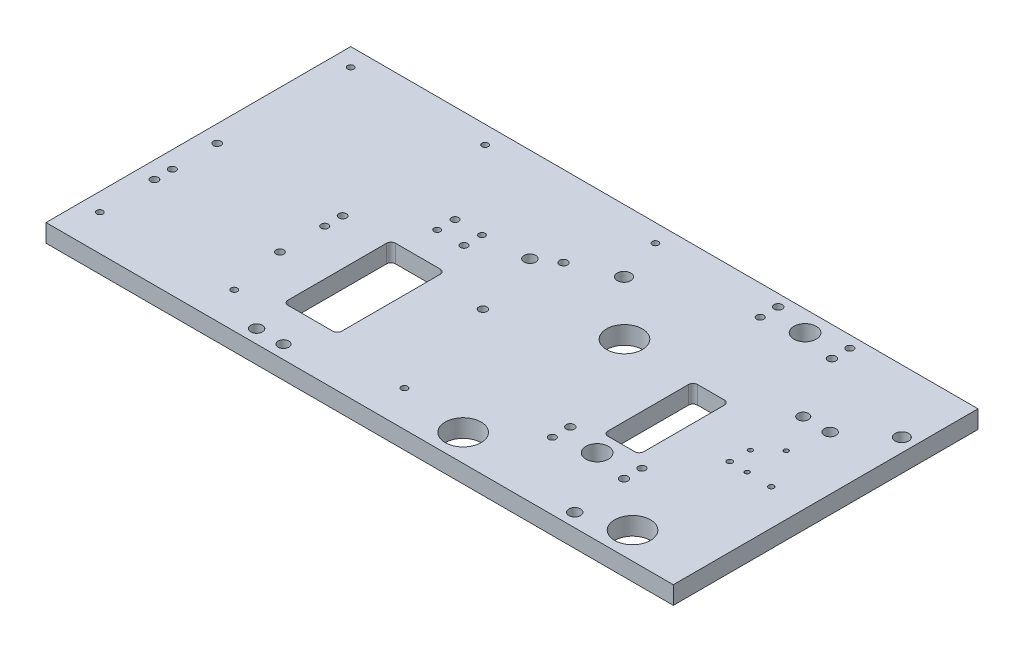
ISO-10303-21;
HEADER;
FILE_DESCRIPTION(('STEP AP214'),'2;1');
FILE_NAME('part.step','',(''),(''),'','','');
FILE_SCHEMA(('AUTOMOTIVE_DESIGN { 1 0 10303 214 1 1 1 1 }'));
ENDSEC;
DATA;
#1=APPLICATION_CONTEXT('core data for automotive mechanical design processes');
#2=APPLICATION_PROTOCOL_DEFINITION('international standard','automotive_design',2000,#1);
#3=PRODUCT_CONTEXT('',#1,'mechanical');
#4=PRODUCT('Part','Part','',(#3));
#5=PRODUCT_RELATED_PRODUCT_CATEGORY('part','',(#4));
#6=PRODUCT_DEFINITION_FORMATION('','',#4);
#7=PRODUCT_DEFINITION_CONTEXT('part definition',#1,'design');
#8=PRODUCT_DEFINITION('design','',#6,#7);
#9=PRODUCT_DEFINITION_SHAPE('','',#8);
#10=(LENGTH_UNIT() NAMED_UNIT(*) SI_UNIT(.MILLI.,.METRE.));
#11=(NAMED_UNIT(*) PLANE_ANGLE_UNIT() SI_UNIT($,.RADIAN.));
#12=(NAMED_UNIT(*) SI_UNIT($,.STERADIAN.) SOLID_ANGLE_UNIT());
#13=UNCERTAINTY_MEASURE_WITH_UNIT(LENGTH_MEASURE(1.E-05),#10,'distance_accuracy_value','');
#14=(GEOMETRIC_REPRESENTATION_CONTEXT(3) GLOBAL_UNCERTAINTY_ASSIGNED_CONTEXT((#13)) GLOBAL_UNIT_ASSIGNED_CONTEXT((#10,
#11,#12)) REPRESENTATION_CONTEXT('',''));
#15=CARTESIAN_POINT('',(0.,0.,0.));
#16=DIRECTION('',(0.,0.,1.));
#17=DIRECTION('',(1.,0.,0.));
#18=AXIS2_PLACEMENT_3D('',#15,#16,#17);
#19=CARTESIAN_POINT('',(39.9992674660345,-176.420000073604,228.999993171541));
#20=DIRECTION('',(0.,1.,0.));
#21=DIRECTION('',(0.,0.,1.));
#22=AXIS2_PLACEMENT_3D('',#19,#20,#21);
#23=CYLINDRICAL_SURFACE('',#22,4.5);
#24=CARTESIAN_POINT('',(39.9992674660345,-166.420000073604,228.999993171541));
#25=DIRECTION('',(0.,1.,0.));
#26=DIRECTION('',(0.,0.,1.));
#27=AXIS2_PLACEMENT_3D('',#24,#25,#26);
#28=CIRCLE('',#27,4.5);
#29=CARTESIAN_POINT('',(39.9992674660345,-166.420000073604,233.499993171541));
#30=VERTEX_POINT('',#29);
#31=EDGE_CURVE('E558',#30,#30,#28,.T.);
#32=ORIENTED_EDGE('',*,*,#31,.T.);
#33=EDGE_LOOP('',(#32));
#34=FACE_BOUND('',#33,.T.);
#35=CARTESIAN_POINT('',(39.9992674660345,-176.420000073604,228.999993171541));
#36=DIRECTION('',(0.,1.,0.));
#37=DIRECTION('',(0.,0.,1.));
#38=AXIS2_PLACEMENT_3D('',#35,#36,#37);
#39=CIRCLE('',#38,4.5);
#40=CARTESIAN_POINT('',(39.9992674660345,-176.420000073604,233.499993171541));
#41=VERTEX_POINT('',#40);
#42=EDGE_CURVE('E561',#41,#41,#39,.F.);
#43=ORIENTED_EDGE('',*,*,#42,.T.);
#44=EDGE_LOOP('',(#43));
#45=FACE_BOUND('',#44,.T.);
#46=ADVANCED_FACE('F15',(#34,#45),#23,.F.);
#47=CARTESIAN_POINT('',(-40.0007325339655,-176.420000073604,208.999993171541));
#48=DIRECTION('',(0.,1.,0.));
#49=DIRECTION('',(0.,0.,1.));
#50=AXIS2_PLACEMENT_3D('',#47,#48,#49);
#51=CYLINDRICAL_SURFACE('',#50,4.5);
#52=CARTESIAN_POINT('',(-40.0007325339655,-166.420000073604,208.999993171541));
#53=DIRECTION('',(0.,1.,0.));
#54=DIRECTION('',(0.,0.,1.));
#55=AXIS2_PLACEMENT_3D('',#52,#53,#54);
#56=CIRCLE('',#55,4.5);
#57=CARTESIAN_POINT('',(-40.0007325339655,-166.420000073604,213.499993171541));
#58=VERTEX_POINT('',#57);
#59=EDGE_CURVE('E555',#58,#58,#56,.T.);
#60=ORIENTED_EDGE('',*,*,#59,.T.);
#61=EDGE_LOOP('',(#60));
#62=FACE_BOUND('',#61,.T.);
#63=CARTESIAN_POINT('',(-40.0007325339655,-176.420000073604,208.999993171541));
#64=DIRECTION('',(0.,1.,0.));
#65=DIRECTION('',(0.,0.,1.));
#66=AXIS2_PLACEMENT_3D('',#63,#64,#65);
#67=CIRCLE('',#66,4.5);
#68=CARTESIAN_POINT('',(-40.0007325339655,-176.420000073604,213.499993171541));
#69=VERTEX_POINT('',#68);
#70=EDGE_CURVE('E564',#69,#69,#67,.F.);
#71=ORIENTED_EDGE('',*,*,#70,.T.);
#72=EDGE_LOOP('',(#71));
#73=FACE_BOUND('',#72,.T.);
#74=ADVANCED_FACE('F1016',(#62,#73),#51,.F.);
#75=CARTESIAN_POINT('',(-202.501514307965,-176.420000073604,53.999992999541));
#76=DIRECTION('',(0.,1.,0.));
#77=DIRECTION('',(0.,0.,1.));
#78=AXIS2_PLACEMENT_3D('',#75,#76,#77);
#79=CYLINDRICAL_SURFACE('',#78,4.5);
#80=CARTESIAN_POINT('',(-202.501514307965,-166.420000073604,53.999992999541));
#81=DIRECTION('',(0.,1.,0.));
#82=DIRECTION('',(0.,0.,1.));
#83=AXIS2_PLACEMENT_3D('',#80,#81,#82);
#84=CIRCLE('',#83,4.5);
#85=CARTESIAN_POINT('',(-202.501514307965,-166.420000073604,58.499992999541));
#86=VERTEX_POINT('',#85);
#87=EDGE_CURVE('E552',#86,#86,#84,.T.);
#88=ORIENTED_EDGE('',*,*,#87,.T.);
#89=EDGE_LOOP('',(#88));
#90=FACE_BOUND('',#89,.T.);
#91=CARTESIAN_POINT('',(-202.501514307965,-176.420000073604,53.999992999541));
#92=DIRECTION('',(0.,1.,0.));
#93=DIRECTION('',(0.,0.,1.));
#94=AXIS2_PLACEMENT_3D('',#91,#92,#93);
#95=CIRCLE('',#94,4.5);
#96=CARTESIAN_POINT('',(-202.501514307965,-176.420000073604,58.499992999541));
#97=VERTEX_POINT('',#96);
#98=EDGE_CURVE('E566',#97,#97,#95,.F.);
#99=ORIENTED_EDGE('',*,*,#98,.T.);
#100=EDGE_LOOP('',(#99));
#101=FACE_BOUND('',#100,.T.);
#102=ADVANCED_FACE('F1022',(#90,#101),#79,.F.);
#103=CARTESIAN_POINT('',(-202.501514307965,-176.420000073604,143.999992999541));
#104=DIRECTION('',(0.,1.,0.));
#105=DIRECTION('',(0.,0.,1.));
#106=AXIS2_PLACEMENT_3D('',#103,#104,#105);
#107=CYLINDRICAL_SURFACE('',#106,4.5);
#108=CARTESIAN_POINT('',(-202.501514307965,-166.420000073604,143.999992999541));
#109=DIRECTION('',(0.,1.,0.));
#110=DIRECTION('',(0.,0.,1.));
#111=AXIS2_PLACEMENT_3D('',#108,#109,#110);
#112=CIRCLE('',#111,4.5);
#113=CARTESIAN_POINT('',(-202.501514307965,-166.420000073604,148.499992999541));
#114=VERTEX_POINT('',#113);
#115=EDGE_CURVE('E549',#114,#114,#112,.T.);
#116=ORIENTED_EDGE('',*,*,#115,.T.);
#117=EDGE_LOOP('',(#116));
#118=FACE_BOUND('',#117,.T.);
#119=CARTESIAN_POINT('',(-202.501514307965,-176.420000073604,143.999992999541));
#120=DIRECTION('',(0.,1.,0.));
#121=DIRECTION('',(0.,0.,1.));
#122=AXIS2_PLACEMENT_3D('',#119,#120,#121);
#123=CIRCLE('',#122,4.5);
#124=CARTESIAN_POINT('',(-202.501514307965,-176.420000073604,148.499992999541));
#125=VERTEX_POINT('',#124);
#126=EDGE_CURVE('E19',#125,#125,#123,.F.);
#127=ORIENTED_EDGE('',*,*,#126,.T.);
#128=EDGE_LOOP('',(#127));
#129=FACE_BOUND('',#128,.T.);
#130=ADVANCED_FACE('F573',(#118,#129),#107,.F.);
#131=CARTESIAN_POINT('',(-202.501514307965,-176.420000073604,143.999992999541));
#132=DIRECTION('',(0.,1.,0.));
#133=DIRECTION('',(0.,0.,1.));
#134=AXIS2_PLACEMENT_3D('',#131,#132,#133);
#135=PLANE('',#134);
#136=ORIENTED_EDGE('',*,*,#126,.F.);
#137=EDGE_LOOP('',(#136));
#138=FACE_BOUND('',#137,.T.);
#139=CARTESIAN_POINT('',(-202.501514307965,-176.420000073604,143.999992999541));
#140=DIRECTION('',(0.,1.,0.));
#141=DIRECTION('',(0.,0.,1.));
#142=AXIS2_PLACEMENT_3D('',#139,#140,#141);
#143=CIRCLE('',#142,7.50000000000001);
#144=CARTESIAN_POINT('',(-202.501514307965,-176.420000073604,151.499992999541));
#145=VERTEX_POINT('',#144);
#146=EDGE_CURVE('E529',#145,#145,#143,.F.);
#147=ORIENTED_EDGE('',*,*,#146,.T.);
#148=EDGE_LOOP('',(#147));
#149=FACE_BOUND('',#148,.T.);
#150=ADVANCED_FACE('F575',(#138,#149),#135,.F.);
#151=CARTESIAN_POINT('',(-202.501514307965,-176.420000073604,53.999992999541));
#152=DIRECTION('',(0.,1.,0.));
#153=DIRECTION('',(0.,0.,1.));
#154=AXIS2_PLACEMENT_3D('',#151,#152,#153);
#155=PLANE('',#154);
#156=ORIENTED_EDGE('',*,*,#98,.F.);
#157=EDGE_LOOP('',(#156));
#158=FACE_BOUND('',#157,.T.);
#159=CARTESIAN_POINT('',(-202.501514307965,-176.420000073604,53.999992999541));
#160=DIRECTION('',(0.,1.,0.));
#161=DIRECTION('',(0.,0.,1.));
#162=AXIS2_PLACEMENT_3D('',#159,#160,#161);
#163=CIRCLE('',#162,7.5);
#164=CARTESIAN_POINT('',(-202.501514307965,-176.420000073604,61.499992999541));
#165=VERTEX_POINT('',#164);
#166=EDGE_CURVE('E526',#165,#165,#163,.F.);
#167=ORIENTED_EDGE('',*,*,#166,.T.);
#168=EDGE_LOOP('',(#167));
#169=FACE_BOUND('',#168,.T.);
#170=ADVANCED_FACE('F577',(#158,#169),#155,.F.);
#171=CARTESIAN_POINT('',(-40.0007325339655,-176.420000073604,208.999993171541));
#172=DIRECTION('',(0.,1.,0.));
#173=DIRECTION('',(0.,0.,1.));
#174=AXIS2_PLACEMENT_3D('',#171,#172,#173);
#175=PLANE('',#174);
#176=ORIENTED_EDGE('',*,*,#70,.F.);
#177=EDGE_LOOP('',(#176));
#178=FACE_BOUND('',#177,.T.);
#179=CARTESIAN_POINT('',(-40.0007325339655,-176.420000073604,208.999993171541));
#180=DIRECTION('',(0.,1.,0.));
#181=DIRECTION('',(0.,0.,1.));
#182=AXIS2_PLACEMENT_3D('',#179,#180,#181);
#183=CIRCLE('',#182,7.50000000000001);
#184=CARTESIAN_POINT('',(-40.0007325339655,-176.420000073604,216.499993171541));
#185=VERTEX_POINT('',#184);
#186=EDGE_CURVE('E451',#185,#185,#183,.F.);
#187=ORIENTED_EDGE('',*,*,#186,.T.);
#188=EDGE_LOOP('',(#187));
#189=FACE_BOUND('',#188,.T.);
#190=ADVANCED_FACE('F613',(#178,#189),#175,.F.);
#191=CARTESIAN_POINT('',(39.9992674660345,-176.420000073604,228.999993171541));
#192=DIRECTION('',(0.,1.,0.));
#193=DIRECTION('',(0.,0.,1.));
#194=AXIS2_PLACEMENT_3D('',#191,#192,#193);
#195=PLANE('',#194);
#196=ORIENTED_EDGE('',*,*,#42,.F.);
#197=EDGE_LOOP('',(#196));
#198=FACE_BOUND('',#197,.T.);
#199=CARTESIAN_POINT('',(39.9992674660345,-176.420000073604,228.999993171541));
#200=DIRECTION('',(0.,1.,0.));
#201=DIRECTION('',(0.,0.,1.));
#202=AXIS2_PLACEMENT_3D('',#199,#200,#201);
#203=CIRCLE('',#202,7.50000000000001);
#204=CARTESIAN_POINT('',(39.9992674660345,-176.420000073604,236.499993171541));
#205=VERTEX_POINT('',#204);
#206=EDGE_CURVE('E448',#205,#205,#203,.F.);
#207=ORIENTED_EDGE('',*,*,#206,.T.);
#208=EDGE_LOOP('',(#207));
#209=FACE_BOUND('',#208,.T.);
#210=ADVANCED_FACE('F610',(#198,#209),#195,.F.);
#211=CARTESIAN_POINT('',(-570.000732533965,-166.420000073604,-36.0000068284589));
#212=DIRECTION('',(0.,-1.,0.));
#213=DIRECTION('',(0.,0.,-1.));
#214=AXIS2_PLACEMENT_3D('',#211,#212,#213);
#215=PLANE('',#214);
#216=CARTESIAN_POINT('',(-510.996513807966,-166.420000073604,181.999992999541));
#217=DIRECTION('',(0.,-1.,0.));
#218=DIRECTION('',(0.,0.,-1.));
#219=AXIS2_PLACEMENT_3D('',#216,#217,#218);
#220=CIRCLE('',#219,4.);
#221=CARTESIAN_POINT('',(-510.996513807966,-166.420000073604,177.999992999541));
#222=VERTEX_POINT('',#221);
#223=EDGE_CURVE('E538',#222,#222,#220,.T.);
#224=ORIENTED_EDGE('',*,*,#223,.T.);
#225=EDGE_LOOP('',(#224));
#226=FACE_BOUND('',#225,.T.);
#227=CARTESIAN_POINT('',(-510.996513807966,-166.420000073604,201.999992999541));
#228=DIRECTION('',(0.,-1.,0.));
#229=DIRECTION('',(0.,0.,-1.));
#230=AXIS2_PLACEMENT_3D('',#227,#228,#229);
#231=CIRCLE('',#230,4.25);
#232=CARTESIAN_POINT('',(-510.996513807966,-166.420000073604,197.749992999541));
#233=VERTEX_POINT('',#232);
#234=EDGE_CURVE('E535',#233,#233,#231,.T.);
#235=ORIENTED_EDGE('',*,*,#234,.T.);
#236=EDGE_LOOP('',(#235));
#237=FACE_BOUND('',#236,.T.);
#238=CARTESIAN_POINT('',(-510.996513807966,-166.420000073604,131.999992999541));
#239=DIRECTION('',(0.,-1.,0.));
#240=DIRECTION('',(0.,0.,-1.));
#241=AXIS2_PLACEMENT_3D('',#238,#239,#240);
#242=CIRCLE('',#241,4.25);
#243=CARTESIAN_POINT('',(-510.996513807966,-166.420000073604,127.749992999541));
#244=VERTEX_POINT('',#243);
#245=EDGE_CURVE('E532',#244,#244,#242,.T.);
#246=ORIENTED_EDGE('',*,*,#245,.T.);
#247=EDGE_LOOP('',(#246));
#248=FACE_BOUND('',#247,.T.);
#249=ORIENTED_EDGE('',*,*,#115,.F.);
#250=EDGE_LOOP('',(#249));
#251=FACE_BOUND('',#250,.T.);
#252=ORIENTED_EDGE('',*,*,#87,.F.);
#253=EDGE_LOOP('',(#252));
#254=FACE_BOUND('',#253,.T.);
#255=CARTESIAN_POINT('',(-360.000732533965,-166.420000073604,-16.000006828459));
#256=DIRECTION('',(0.,-1.,0.));
#257=DIRECTION('',(0.,0.,-1.));
#258=AXIS2_PLACEMENT_3D('',#255,#256,#257);
#259=CIRCLE('',#258,3.5);
#260=CARTESIAN_POINT('',(-360.000732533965,-166.420000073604,-19.500006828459));
#261=VERTEX_POINT('',#260);
#262=EDGE_CURVE('E523',#261,#261,#259,.T.);
#263=ORIENTED_EDGE('',*,*,#262,.T.);
#264=EDGE_LOOP('',(#263));
#265=FACE_BOUND('',#264,.T.);
#266=CARTESIAN_POINT('',(-170.000732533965,-166.420000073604,-16.000006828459));
#267=DIRECTION('',(0.,-1.,0.));
#268=DIRECTION('',(0.,0.,-1.));
#269=AXIS2_PLACEMENT_3D('',#266,#267,#268);
#270=CIRCLE('',#269,3.5);
#271=CARTESIAN_POINT('',(-170.000732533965,-166.420000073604,-19.500006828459));
#272=VERTEX_POINT('',#271);
#273=EDGE_CURVE('E520',#272,#272,#270,.T.);
#274=ORIENTED_EDGE('',*,*,#273,.T.);
#275=EDGE_LOOP('',(#274));
#276=FACE_BOUND('',#275,.T.);
#277=CARTESIAN_POINT('',(-510.000732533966,-166.420000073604,-16.0000068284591));
#278=DIRECTION('',(0.,-1.,0.));
#279=DIRECTION('',(0.,0.,-1.));
#280=AXIS2_PLACEMENT_3D('',#277,#278,#279);
#281=CIRCLE('',#280,3.5);
#282=CARTESIAN_POINT('',(-510.000732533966,-166.420000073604,-19.5000068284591));
#283=VERTEX_POINT('',#282);
#284=EDGE_CURVE('E517',#283,#283,#281,.T.);
#285=ORIENTED_EDGE('',*,*,#284,.T.);
#286=EDGE_LOOP('',(#285));
#287=FACE_BOUND('',#286,.T.);
#288=CARTESIAN_POINT('',(-170.000732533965,-166.420000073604,263.999993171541));
#289=DIRECTION('',(0.,-1.,0.));
#290=DIRECTION('',(0.,0.,-1.));
#291=AXIS2_PLACEMENT_3D('',#288,#289,#290);
#292=CIRCLE('',#291,3.5);
#293=CARTESIAN_POINT('',(-170.000732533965,-166.420000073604,260.499993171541));
#294=VERTEX_POINT('',#293);
#295=EDGE_CURVE('E514',#294,#294,#292,.T.);
#296=ORIENTED_EDGE('',*,*,#295,.T.);
#297=EDGE_LOOP('',(#296));
#298=FACE_BOUND('',#297,.T.);
#299=CARTESIAN_POINT('',(-360.000732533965,-166.420000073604,263.999993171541));
#300=DIRECTION('',(0.,-1.,0.));
#301=DIRECTION('',(0.,0.,-1.));
#302=AXIS2_PLACEMENT_3D('',#299,#300,#301);
#303=CIRCLE('',#302,3.5);
#304=CARTESIAN_POINT('',(-360.000732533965,-166.420000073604,260.499993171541));
#305=VERTEX_POINT('',#304);
#306=EDGE_CURVE('E511',#305,#305,#303,.T.);
#307=ORIENTED_EDGE('',*,*,#306,.T.);
#308=EDGE_LOOP('',(#307));
#309=FACE_BOUND('',#308,.T.);
#310=CARTESIAN_POINT('',(-510.000732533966,-166.420000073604,263.999993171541));
#311=DIRECTION('',(0.,-1.,0.));
#312=DIRECTION('',(0.,0.,-1.));
#313=AXIS2_PLACEMENT_3D('',#310,#311,#312);
#314=CIRCLE('',#313,3.5);
#315=CARTESIAN_POINT('',(-510.000732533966,-166.420000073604,260.499993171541));
#316=VERTEX_POINT('',#315);
#317=EDGE_CURVE('E508',#316,#316,#314,.T.);
#318=ORIENTED_EDGE('',*,*,#317,.T.);
#319=EDGE_LOOP('',(#318));
#320=FACE_BOUND('',#319,.T.);
#321=CARTESIAN_POINT('',(79.9992674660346,-166.420000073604,68.999993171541));
#322=DIRECTION('',(0.,-1.,0.));
#323=DIRECTION('',(0.,0.,-1.));
#324=AXIS2_PLACEMENT_3D('',#321,#322,#323);
#325=CIRCLE('',#324,6.00000000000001);
#326=CARTESIAN_POINT('',(79.9992674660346,-166.420000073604,62.999993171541));
#327=VERTEX_POINT('',#326);
#328=EDGE_CURVE('E505',#327,#327,#325,.T.);
#329=ORIENTED_EDGE('',*,*,#328,.T.);
#330=EDGE_LOOP('',(#329));
#331=FACE_BOUND('',#330,.T.);
#332=CARTESIAN_POINT('',(-280.000732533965,-166.420000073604,288.999993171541));
#333=DIRECTION('',(0.,-1.,0.));
#334=DIRECTION('',(0.,0.,-1.));
#335=AXIS2_PLACEMENT_3D('',#332,#333,#334);
#336=CIRCLE('',#335,6.00000000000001);
#337=CARTESIAN_POINT('',(-280.000732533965,-166.420000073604,282.999993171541));
#338=VERTEX_POINT('',#337);
#339=EDGE_CURVE('E502',#338,#338,#336,.T.);
#340=ORIENTED_EDGE('',*,*,#339,.T.);
#341=EDGE_LOOP('',(#340));
#342=FACE_BOUND('',#341,.T.);
#343=CARTESIAN_POINT('',(109.999267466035,-166.420000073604,68.999993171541));
#344=DIRECTION('',(0.,-1.,0.));
#345=DIRECTION('',(0.,0.,-1.));
#346=AXIS2_PLACEMENT_3D('',#343,#344,#345);
#347=CIRCLE('',#346,6.5);
#348=CARTESIAN_POINT('',(109.999267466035,-166.420000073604,62.499993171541));
#349=VERTEX_POINT('',#348);
#350=EDGE_CURVE('E499',#349,#349,#347,.T.);
#351=ORIENTED_EDGE('',*,*,#350,.T.);
#352=EDGE_LOOP('',(#351));
#353=FACE_BOUND('',#352,.T.);
#354=CARTESIAN_POINT('',(44.9992674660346,-166.420000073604,288.999993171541));
#355=DIRECTION('',(0.,-1.,0.));
#356=DIRECTION('',(0.,0.,-1.));
#357=AXIS2_PLACEMENT_3D('',#354,#355,#356);
#358=CIRCLE('',#357,6.50000000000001);
#359=CARTESIAN_POINT('',(44.9992674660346,-166.420000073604,282.499993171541));
#360=VERTEX_POINT('',#359);
#361=EDGE_CURVE('E496',#360,#360,#358,.T.);
#362=ORIENTED_EDGE('',*,*,#361,.T.);
#363=EDGE_LOOP('',(#362));
#364=FACE_BOUND('',#363,.T.);
#365=CARTESIAN_POINT('',(-225.000732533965,-166.420000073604,68.999993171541));
#366=DIRECTION('',(0.,-1.,0.));
#367=DIRECTION('',(0.,0.,-1.));
#368=AXIS2_PLACEMENT_3D('',#365,#366,#367);
#369=CIRCLE('',#368,6.5);
#370=CARTESIAN_POINT('',(-225.000732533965,-166.420000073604,62.499993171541));
#371=VERTEX_POINT('',#370);
#372=EDGE_CURVE('E493',#371,#371,#369,.T.);
#373=ORIENTED_EDGE('',*,*,#372,.T.);
#374=EDGE_LOOP('',(#373));
#375=FACE_BOUND('',#374,.T.);
#376=CARTESIAN_POINT('',(-310.000732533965,-166.420000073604,288.999993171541));
#377=DIRECTION('',(0.,-1.,0.));
#378=DIRECTION('',(0.,0.,-1.));
#379=AXIS2_PLACEMENT_3D('',#376,#377,#378);
#380=CIRCLE('',#379,6.50000000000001);
#381=CARTESIAN_POINT('',(-310.000732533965,-166.420000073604,282.499993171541));
#382=VERTEX_POINT('',#381);
#383=EDGE_CURVE('E490',#382,#382,#380,.T.);
#384=ORIENTED_EDGE('',*,*,#383,.T.);
#385=EDGE_LOOP('',(#384));
#386=FACE_BOUND('',#385,.T.);
#387=CARTESIAN_POINT('',(94.5000000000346,-166.420000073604,273.999999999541));
#388=DIRECTION('',(0.,-1.,0.));
#389=DIRECTION('',(0.,0.,-1.));
#390=AXIS2_PLACEMENT_3D('',#387,#388,#389);
#391=CIRCLE('',#390,20.);
#392=CARTESIAN_POINT('',(94.5000000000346,-166.420000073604,253.999999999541));
#393=VERTEX_POINT('',#392);
#394=EDGE_CURVE('E487',#393,#393,#391,.T.);
#395=ORIENTED_EDGE('',*,*,#394,.T.);
#396=EDGE_LOOP('',(#395));
#397=FACE_BOUND('',#396,.T.);
#398=CARTESIAN_POINT('',(-94.4999999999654,-166.420000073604,273.999999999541));
#399=DIRECTION('',(0.,-1.,0.));
#400=DIRECTION('',(0.,0.,-1.));
#401=AXIS2_PLACEMENT_3D('',#398,#399,#400);
#402=CIRCLE('',#401,20.);
#403=CARTESIAN_POINT('',(-94.4999999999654,-166.420000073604,253.999999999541));
#404=VERTEX_POINT('',#403);
#405=EDGE_CURVE('E484',#404,#404,#402,.T.);
#406=ORIENTED_EDGE('',*,*,#405,.T.);
#407=EDGE_LOOP('',(#406));
#408=FACE_BOUND('',#407,.T.);
#409=CARTESIAN_POINT('',(-94.4999999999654,-166.420000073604,93.999999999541));
#410=DIRECTION('',(0.,-1.,0.));
#411=DIRECTION('',(0.,0.,-1.));
#412=AXIS2_PLACEMENT_3D('',#409,#410,#411);
#413=CIRCLE('',#412,20.);
#414=CARTESIAN_POINT('',(-94.4999999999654,-166.420000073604,73.999999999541));
#415=VERTEX_POINT('',#414);
#416=EDGE_CURVE('E481',#415,#415,#413,.T.);
#417=ORIENTED_EDGE('',*,*,#416,.T.);
#418=EDGE_LOOP('',(#417));
#419=FACE_BOUND('',#418,.T.);
#420=CARTESIAN_POINT('',(129.937300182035,-166.420000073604,154.639647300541));
#421=DIRECTION('',(0.,-1.,0.));
#422=DIRECTION('',(0.,0.,-1.));
#423=AXIS2_PLACEMENT_3D('',#420,#421,#422);
#424=CIRCLE('',#423,3.);
#425=CARTESIAN_POINT('',(129.937300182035,-166.420000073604,151.639647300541));
#426=VERTEX_POINT('',#425);
#427=EDGE_CURVE('E478',#426,#426,#424,.T.);
#428=ORIENTED_EDGE('',*,*,#427,.T.);
#429=EDGE_LOOP('',(#428));
#430=FACE_BOUND('',#429,.T.);
#431=CARTESIAN_POINT('',(82.4512315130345,-166.420000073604,153.489307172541));
#432=DIRECTION('',(0.,-1.,0.));
#433=DIRECTION('',(0.,0.,-1.));
#434=AXIS2_PLACEMENT_3D('',#431,#432,#433);
#435=CIRCLE('',#434,3.);
#436=CARTESIAN_POINT('',(82.4512315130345,-166.420000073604,150.489307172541));
#437=VERTEX_POINT('',#436);
#438=EDGE_CURVE('E475',#437,#437,#435,.T.);
#439=ORIENTED_EDGE('',*,*,#438,.T.);
#440=EDGE_LOOP('',(#439));
#441=FACE_BOUND('',#440,.T.);
#442=CARTESIAN_POINT('',(102.445365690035,-166.420000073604,153.973660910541));
#443=DIRECTION('',(0.,-1.,0.));
#444=DIRECTION('',(0.,0.,-1.));
#445=AXIS2_PLACEMENT_3D('',#442,#443,#444);
#446=CIRCLE('',#445,2.5);
#447=CARTESIAN_POINT('',(102.445365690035,-166.420000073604,151.473660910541));
#448=VERTEX_POINT('',#447);
#449=EDGE_CURVE('E472',#448,#448,#446,.T.);
#450=ORIENTED_EDGE('',*,*,#449,.T.);
#451=EDGE_LOOP('',(#450));
#452=FACE_BOUND('',#451,.T.);
#453=CARTESIAN_POINT('',(82.9961294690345,-166.420000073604,130.995906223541));
#454=DIRECTION('',(0.,-1.,0.));
#455=DIRECTION('',(0.,0.,-1.));
#456=AXIS2_PLACEMENT_3D('',#453,#454,#455);
#457=CIRCLE('',#456,2.5);
#458=CARTESIAN_POINT('',(82.9961294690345,-166.420000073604,128.495906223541));
#459=VERTEX_POINT('',#458);
#460=EDGE_CURVE('E469',#459,#459,#457,.T.);
#461=ORIENTED_EDGE('',*,*,#460,.T.);
#462=EDGE_LOOP('',(#461));
#463=FACE_BOUND('',#462,.T.);
#464=CARTESIAN_POINT('',(103.474617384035,-166.420000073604,111.486125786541));
#465=DIRECTION('',(0.,-1.,0.));
#466=DIRECTION('',(0.,0.,-1.));
#467=AXIS2_PLACEMENT_3D('',#464,#465,#466);
#468=CIRCLE('',#467,2.5);
#469=CARTESIAN_POINT('',(103.474617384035,-166.420000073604,108.986125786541));
#470=VERTEX_POINT('',#469);
#471=EDGE_CURVE('E466',#470,#470,#468,.T.);
#472=ORIENTED_EDGE('',*,*,#471,.T.);
#473=EDGE_LOOP('',(#472));
#474=FACE_BOUND('',#473,.T.);
#475=CARTESIAN_POINT('',(39.9992674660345,-166.420000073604,-23.000006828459));
#476=DIRECTION('',(0.,-1.,0.));
#477=DIRECTION('',(0.,0.,-1.));
#478=AXIS2_PLACEMENT_3D('',#475,#476,#477);
#479=CIRCLE('',#478,4.);
#480=CARTESIAN_POINT('',(39.9992674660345,-166.420000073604,-27.000006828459));
#481=VERTEX_POINT('',#480);
#482=EDGE_CURVE('E463',#481,#481,#479,.T.);
#483=ORIENTED_EDGE('',*,*,#482,.T.);
#484=EDGE_LOOP('',(#483));
#485=FACE_BOUND('',#484,.T.);
#486=CARTESIAN_POINT('',(-40.0007325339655,-166.420000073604,-3.00000682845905));
#487=DIRECTION('',(0.,-1.,0.));
#488=DIRECTION('',(0.,0.,-1.));
#489=AXIS2_PLACEMENT_3D('',#486,#487,#488);
#490=CIRCLE('',#489,4.);
#491=CARTESIAN_POINT('',(-40.0007325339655,-166.420000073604,-7.00000682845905));
#492=VERTEX_POINT('',#491);
#493=EDGE_CURVE('E460',#492,#492,#490,.T.);
#494=ORIENTED_EDGE('',*,*,#493,.T.);
#495=EDGE_LOOP('',(#494));
#496=FACE_BOUND('',#495,.T.);
#497=CARTESIAN_POINT('',(39.9992674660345,-166.420000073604,-3.00000682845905));
#498=DIRECTION('',(0.,-1.,0.));
#499=DIRECTION('',(0.,0.,-1.));
#500=AXIS2_PLACEMENT_3D('',#497,#498,#499);
#501=CIRCLE('',#500,4.5);
#502=CARTESIAN_POINT('',(39.9992674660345,-166.420000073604,-7.50000682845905));
#503=VERTEX_POINT('',#502);
#504=EDGE_CURVE('E457',#503,#503,#501,.T.);
#505=ORIENTED_EDGE('',*,*,#504,.T.);
#506=EDGE_LOOP('',(#505));
#507=FACE_BOUND('',#506,.T.);
#508=CARTESIAN_POINT('',(-40.0007325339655,-166.420000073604,-23.000006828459));
#509=DIRECTION('',(0.,-1.,0.));
#510=DIRECTION('',(0.,0.,-1.));
#511=AXIS2_PLACEMENT_3D('',#508,#509,#510);
#512=CIRCLE('',#511,4.5);
#513=CARTESIAN_POINT('',(-40.0007325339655,-166.420000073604,-27.5000068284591));
#514=VERTEX_POINT('',#513);
#515=EDGE_CURVE('E454',#514,#514,#512,.T.);
#516=ORIENTED_EDGE('',*,*,#515,.T.);
#517=EDGE_LOOP('',(#516));
#518=FACE_BOUND('',#517,.T.);
#519=ORIENTED_EDGE('',*,*,#59,.F.);
#520=EDGE_LOOP('',(#519));
#521=FACE_BOUND('',#520,.T.);
#522=ORIENTED_EDGE('',*,*,#31,.F.);
#523=EDGE_LOOP('',(#522));
#524=FACE_BOUND('',#523,.T.);
#525=CARTESIAN_POINT('',(-40.0007325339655,-166.420000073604,228.999993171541));
#526=DIRECTION('',(0.,-1.,0.));
#527=DIRECTION('',(0.,0.,-1.));
#528=AXIS2_PLACEMENT_3D('',#525,#526,#527);
#529=CIRCLE('',#528,4.);
#530=CARTESIAN_POINT('',(-40.0007325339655,-166.420000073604,224.999993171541));
#531=VERTEX_POINT('',#530);
#532=EDGE_CURVE('E445',#531,#531,#529,.T.);
#533=ORIENTED_EDGE('',*,*,#532,.T.);
#534=EDGE_LOOP('',(#533));
#535=FACE_BOUND('',#534,.T.);
#536=CARTESIAN_POINT('',(39.9992674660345,-166.420000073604,208.999993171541));
#537=DIRECTION('',(0.,-1.,0.));
#538=DIRECTION('',(0.,0.,-1.));
#539=AXIS2_PLACEMENT_3D('',#536,#537,#538);
#540=CIRCLE('',#539,4.);
#541=CARTESIAN_POINT('',(39.9992674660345,-166.420000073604,204.999993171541));
#542=VERTEX_POINT('',#541);
#543=EDGE_CURVE('E442',#542,#542,#540,.T.);
#544=ORIENTED_EDGE('',*,*,#543,.T.);
#545=EDGE_LOOP('',(#544));
#546=FACE_BOUND('',#545,.T.);
#547=CARTESIAN_POINT('',(-274.646513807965,-166.420000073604,72.8759370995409));
#548=DIRECTION('',(0.,-1.,0.));
#549=DIRECTION('',(0.,0.,-1.));
#550=AXIS2_PLACEMENT_3D('',#547,#548,#549);
#551=CIRCLE('',#550,3.5);
#552=CARTESIAN_POINT('',(-274.646513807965,-166.420000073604,69.3759370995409));
#553=VERTEX_POINT('',#552);
#554=EDGE_CURVE('E439',#553,#553,#551,.T.);
#555=ORIENTED_EDGE('',*,*,#554,.T.);
#556=EDGE_LOOP('',(#555));
#557=FACE_BOUND('',#556,.T.);
#558=CARTESIAN_POINT('',(-304.646513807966,-166.420000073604,92.8759370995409));
#559=DIRECTION('',(0.,-1.,0.));
#560=DIRECTION('',(0.,0.,-1.));
#561=AXIS2_PLACEMENT_3D('',#558,#559,#560);
#562=CIRCLE('',#561,3.5);
#563=CARTESIAN_POINT('',(-304.646513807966,-166.420000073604,89.3759370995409));
#564=VERTEX_POINT('',#563);
#565=EDGE_CURVE('E436',#564,#564,#562,.T.);
#566=ORIENTED_EDGE('',*,*,#565,.T.);
#567=EDGE_LOOP('',(#566));
#568=FACE_BOUND('',#567,.T.);
#569=CARTESIAN_POINT('',(-304.646513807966,-166.420000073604,72.8759370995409));
#570=DIRECTION('',(0.,-1.,0.));
#571=DIRECTION('',(0.,0.,-1.));
#572=AXIS2_PLACEMENT_3D('',#569,#570,#571);
#573=CIRCLE('',#572,4.);
#574=CARTESIAN_POINT('',(-304.646513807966,-166.420000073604,68.8759370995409));
#575=VERTEX_POINT('',#574);
#576=EDGE_CURVE('E433',#575,#575,#573,.T.);
#577=ORIENTED_EDGE('',*,*,#576,.T.);
#578=EDGE_LOOP('',(#577));
#579=FACE_BOUND('',#578,.T.);
#580=CARTESIAN_POINT('',(-274.646513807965,-166.420000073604,92.8759370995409));
#581=DIRECTION('',(0.,-1.,0.));
#582=DIRECTION('',(0.,0.,-1.));
#583=AXIS2_PLACEMENT_3D('',#580,#581,#582);
#584=CIRCLE('',#583,4.);
#585=CARTESIAN_POINT('',(-274.646513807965,-166.420000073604,88.8759370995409));
#586=VERTEX_POINT('',#585);
#587=EDGE_CURVE('E430',#586,#586,#584,.T.);
#588=ORIENTED_EDGE('',*,*,#587,.T.);
#589=EDGE_LOOP('',(#588));
#590=FACE_BOUND('',#589,.T.);
#591=CARTESIAN_POINT('',(154.999267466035,-166.420000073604,33.999993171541));
#592=DIRECTION('',(0.,-1.,0.));
#593=DIRECTION('',(0.,0.,-1.));
#594=AXIS2_PLACEMENT_3D('',#591,#592,#593);
#595=CIRCLE('',#594,7.5);
#596=CARTESIAN_POINT('',(154.999267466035,-166.420000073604,26.499993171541));
#597=VERTEX_POINT('',#596);
#598=EDGE_CURVE('E427',#597,#597,#595,.T.);
#599=ORIENTED_EDGE('',*,*,#598,.T.);
#600=EDGE_LOOP('',(#599));
#601=FACE_BOUND('',#600,.T.);
#602=CARTESIAN_POINT('',(-155.000732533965,-166.420000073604,33.999993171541));
#603=DIRECTION('',(0.,-1.,0.));
#604=DIRECTION('',(0.,0.,-1.));
#605=AXIS2_PLACEMENT_3D('',#602,#603,#604);
#606=CIRCLE('',#605,7.5);
#607=CARTESIAN_POINT('',(-155.000732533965,-166.420000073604,26.499993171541));
#608=VERTEX_POINT('',#607);
#609=EDGE_CURVE('E424',#608,#608,#606,.T.);
#610=ORIENTED_EDGE('',*,*,#609,.T.);
#611=EDGE_LOOP('',(#610));
#612=FACE_BOUND('',#611,.T.);
#613=CARTESIAN_POINT('',(-370.996513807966,-166.420000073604,131.999992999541));
#614=DIRECTION('',(0.,-1.,0.));
#615=DIRECTION('',(0.,0.,-1.));
#616=AXIS2_PLACEMENT_3D('',#613,#614,#615);
#617=CIRCLE('',#616,4.25);
#618=CARTESIAN_POINT('',(-370.996513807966,-166.420000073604,127.749992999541));
#619=VERTEX_POINT('',#618);
#620=EDGE_CURVE('E421',#619,#619,#617,.T.);
#621=ORIENTED_EDGE('',*,*,#620,.T.);
#622=EDGE_LOOP('',(#621));
#623=FACE_BOUND('',#622,.T.);
#624=CARTESIAN_POINT('',(-370.996513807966,-166.420000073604,201.999992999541));
#625=DIRECTION('',(0.,-1.,0.));
#626=DIRECTION('',(0.,0.,-1.));
#627=AXIS2_PLACEMENT_3D('',#624,#625,#626);
#628=CIRCLE('',#627,4.25);
#629=CARTESIAN_POINT('',(-370.996513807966,-166.420000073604,197.749992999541));
#630=VERTEX_POINT('',#629);
#631=EDGE_CURVE('E418',#630,#630,#628,.T.);
#632=ORIENTED_EDGE('',*,*,#631,.T.);
#633=EDGE_LOOP('',(#632));
#634=FACE_BOUND('',#633,.T.);
#635=CARTESIAN_POINT('',(-370.996513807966,-166.420000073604,151.999992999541));
#636=DIRECTION('',(0.,-1.,0.));
#637=DIRECTION('',(0.,0.,-1.));
#638=AXIS2_PLACEMENT_3D('',#635,#636,#637);
#639=CIRCLE('',#638,4.);
#640=CARTESIAN_POINT('',(-370.996513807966,-166.420000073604,147.999992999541));
#641=VERTEX_POINT('',#640);
#642=EDGE_CURVE('E415',#641,#641,#639,.T.);
#643=ORIENTED_EDGE('',*,*,#642,.T.);
#644=EDGE_LOOP('',(#643));
#645=FACE_BOUND('',#644,.T.);
#646=CARTESIAN_POINT('',(-265.000732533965,-166.420000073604,133.999993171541));
#647=DIRECTION('',(0.,-1.,0.));
#648=DIRECTION('',(0.,0.,-1.));
#649=AXIS2_PLACEMENT_3D('',#646,#647,#648);
#650=CIRCLE('',#649,5.);
#651=CARTESIAN_POINT('',(-265.000732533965,-166.420000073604,128.999993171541));
#652=VERTEX_POINT('',#651);
#653=CARTESIAN_POINT('',(-260.000732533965,-166.420000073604,133.999993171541));
#654=VERTEX_POINT('',#653);
#655=EDGE_CURVE('E413',#652,#654,#650,.T.);
#656=ORIENTED_EDGE('',*,*,#655,.T.);
#657=DIRECTION('',(0.,0.,-1.));
#658=VECTOR('',#657,1.);
#659=CARTESIAN_POINT('',(-260.000732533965,-166.420000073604,-36.0000068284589));
#660=LINE('',#659,#658);
#661=CARTESIAN_POINT('',(-260.000732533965,-166.420000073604,243.999993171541));
#662=VERTEX_POINT('',#661);
#663=EDGE_CURVE('E410',#654,#662,#660,.F.);
#664=ORIENTED_EDGE('',*,*,#663,.T.);
#665=CARTESIAN_POINT('',(-265.000732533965,-166.420000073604,243.999993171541));
#666=DIRECTION('',(0.,-1.,0.));
#667=DIRECTION('',(0.,0.,-1.));
#668=AXIS2_PLACEMENT_3D('',#665,#666,#667);
#669=CIRCLE('',#668,5.);
#670=CARTESIAN_POINT('',(-265.000732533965,-166.420000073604,248.999993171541));
#671=VERTEX_POINT('',#670);
#672=EDGE_CURVE('E407',#662,#671,#669,.T.);
#673=ORIENTED_EDGE('',*,*,#672,.T.);
#674=DIRECTION('',(1.,0.,0.));
#675=VECTOR('',#674,1.);
#676=CARTESIAN_POINT('',(-570.000732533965,-166.420000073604,248.999993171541));
#677=LINE('',#676,#675);
#678=CARTESIAN_POINT('',(-315.000732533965,-166.420000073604,248.999993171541));
#679=VERTEX_POINT('',#678);
#680=EDGE_CURVE('E404',#671,#679,#677,.F.);
#681=ORIENTED_EDGE('',*,*,#680,.T.);
#682=CARTESIAN_POINT('',(-315.000732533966,-166.420000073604,243.999993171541));
#683=DIRECTION('',(0.,-1.,0.));
#684=DIRECTION('',(0.,0.,-1.));
#685=AXIS2_PLACEMENT_3D('',#682,#683,#684);
#686=CIRCLE('',#685,5.);
#687=CARTESIAN_POINT('',(-320.000732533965,-166.420000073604,243.999993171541));
#688=VERTEX_POINT('',#687);
#689=EDGE_CURVE('E401',#679,#688,#686,.T.);
#690=ORIENTED_EDGE('',*,*,#689,.T.);
#691=DIRECTION('',(0.,0.,-1.));
#692=VECTOR('',#691,1.);
#693=CARTESIAN_POINT('',(-320.000732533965,-166.420000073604,-36.0000068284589));
#694=LINE('',#693,#692);
#695=CARTESIAN_POINT('',(-320.000732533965,-166.420000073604,133.999993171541));
#696=VERTEX_POINT('',#695);
#697=EDGE_CURVE('E398',#688,#696,#694,.T.);
#698=ORIENTED_EDGE('',*,*,#697,.T.);
#699=CARTESIAN_POINT('',(-315.000732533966,-166.420000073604,133.999993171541));
#700=DIRECTION('',(0.,-1.,0.));
#701=DIRECTION('',(0.,0.,-1.));
#702=AXIS2_PLACEMENT_3D('',#699,#700,#701);
#703=CIRCLE('',#702,5.);
#704=CARTESIAN_POINT('',(-315.000732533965,-166.420000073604,128.999993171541));
#705=VERTEX_POINT('',#704);
#706=EDGE_CURVE('E395',#696,#705,#703,.T.);
#707=ORIENTED_EDGE('',*,*,#706,.T.);
#708=DIRECTION('',(1.,0.,0.));
#709=VECTOR('',#708,1.);
#710=CARTESIAN_POINT('',(-570.000732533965,-166.420000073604,128.999993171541));
#711=LINE('',#710,#709);
#712=EDGE_CURVE('E391',#705,#652,#711,.T.);
#713=ORIENTED_EDGE('',*,*,#712,.T.);
#714=EDGE_LOOP('',(#656,#664,#673,#681,#690,#698,#707,#713));
#715=FACE_BOUND('',#714,.T.);
#716=CARTESIAN_POINT('',(-10.0007325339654,-166.420000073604,101.999993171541));
#717=DIRECTION('',(0.,-1.,0.));
#718=DIRECTION('',(0.,0.,-1.));
#719=AXIS2_PLACEMENT_3D('',#716,#717,#718);
#720=CIRCLE('',#719,5.);
#721=CARTESIAN_POINT('',(-15.0007325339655,-166.420000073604,101.999993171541));
#722=VERTEX_POINT('',#721);
#723=CARTESIAN_POINT('',(-10.0007325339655,-166.420000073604,96.9999931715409));
#724=VERTEX_POINT('',#723);
#725=EDGE_CURVE('E388',#722,#724,#720,.T.);
#726=ORIENTED_EDGE('',*,*,#725,.T.);
#727=DIRECTION('',(1.,0.,0.));
#728=VECTOR('',#727,1.);
#729=CARTESIAN_POINT('',(-570.000732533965,-166.420000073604,96.9999931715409));
#730=LINE('',#729,#728);
#731=CARTESIAN_POINT('',(19.9992674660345,-166.420000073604,96.9999931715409));
#732=VERTEX_POINT('',#731);
#733=EDGE_CURVE('E385',#724,#732,#730,.T.);
#734=ORIENTED_EDGE('',*,*,#733,.T.);
#735=CARTESIAN_POINT('',(19.9992674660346,-166.420000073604,101.999993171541));
#736=DIRECTION('',(0.,-1.,0.));
#737=DIRECTION('',(0.,0.,-1.));
#738=AXIS2_PLACEMENT_3D('',#735,#736,#737);
#739=CIRCLE('',#738,5.);
#740=CARTESIAN_POINT('',(24.9992674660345,-166.420000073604,101.999993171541));
#741=VERTEX_POINT('',#740);
#742=EDGE_CURVE('E382',#732,#741,#739,.T.);
#743=ORIENTED_EDGE('',*,*,#742,.T.);
#744=DIRECTION('',(0.,0.,-1.));
#745=VECTOR('',#744,1.);
#746=CARTESIAN_POINT('',(24.9992674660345,-166.420000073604,-36.0000068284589));
#747=LINE('',#746,#745);
#748=CARTESIAN_POINT('',(24.9992674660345,-166.420000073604,191.999993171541));
#749=VERTEX_POINT('',#748);
#750=EDGE_CURVE('E379',#741,#749,#747,.F.);
#751=ORIENTED_EDGE('',*,*,#750,.T.);
#752=CARTESIAN_POINT('',(19.9992674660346,-166.420000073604,191.999993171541));
#753=DIRECTION('',(0.,-1.,0.));
#754=DIRECTION('',(0.,0.,-1.));
#755=AXIS2_PLACEMENT_3D('',#752,#753,#754);
#756=CIRCLE('',#755,5.);
#757=CARTESIAN_POINT('',(19.9992674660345,-166.420000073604,196.999993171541));
#758=VERTEX_POINT('',#757);
#759=EDGE_CURVE('E376',#749,#758,#756,.T.);
#760=ORIENTED_EDGE('',*,*,#759,.T.);
#761=DIRECTION('',(1.,0.,0.));
#762=VECTOR('',#761,1.);
#763=CARTESIAN_POINT('',(-570.000732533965,-166.420000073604,196.999993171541));
#764=LINE('',#763,#762);
#765=CARTESIAN_POINT('',(-10.0007325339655,-166.420000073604,196.999993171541));
#766=VERTEX_POINT('',#765);
#767=EDGE_CURVE('E373',#758,#766,#764,.F.);
#768=ORIENTED_EDGE('',*,*,#767,.T.);
#769=CARTESIAN_POINT('',(-10.0007325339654,-166.420000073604,191.999993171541));
#770=DIRECTION('',(0.,-1.,0.));
#771=DIRECTION('',(0.,0.,-1.));
#772=AXIS2_PLACEMENT_3D('',#769,#770,#771);
#773=CIRCLE('',#772,5.);
#774=CARTESIAN_POINT('',(-15.0007325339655,-166.420000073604,191.999993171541));
#775=VERTEX_POINT('',#774);
#776=EDGE_CURVE('E370',#766,#775,#773,.T.);
#777=ORIENTED_EDGE('',*,*,#776,.T.);
#778=DIRECTION('',(0.,0.,-1.));
#779=VECTOR('',#778,1.);
#780=CARTESIAN_POINT('',(-15.0007325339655,-166.420000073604,-36.0000068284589));
#781=LINE('',#780,#779);
#782=EDGE_CURVE('E367',#775,#722,#781,.T.);
#783=ORIENTED_EDGE('',*,*,#782,.T.);
#784=EDGE_LOOP('',(#726,#734,#743,#751,#760,#768,#777,#783));
#785=FACE_BOUND('',#784,.T.);
#786=DIRECTION('',(1.,0.,0.));
#787=VECTOR('',#786,1.);
#788=CARTESIAN_POINT('',(164.999267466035,-166.420000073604,303.999993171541));
#789=LINE('',#788,#787);
#790=CARTESIAN_POINT('',(169.999267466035,-166.420000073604,303.999993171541));
#791=VERTEX_POINT('',#790);
#792=CARTESIAN_POINT('',(-530.000732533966,-166.420000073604,303.999993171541));
#793=VERTEX_POINT('',#792);
#794=EDGE_CURVE('E159',#791,#793,#789,.F.);
#795=ORIENTED_EDGE('',*,*,#794,.F.);
#796=DIRECTION('',(0.,0.,-1.));
#797=VECTOR('',#796,1.);
#798=CARTESIAN_POINT('',(169.999267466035,-166.420000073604,-36.0000068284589));
#799=LINE('',#798,#797);
#800=CARTESIAN_POINT('',(169.999267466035,-166.420000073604,-36.0000068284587));
#801=VERTEX_POINT('',#800);
#802=EDGE_CURVE('E150',#791,#801,#799,.T.);
#803=ORIENTED_EDGE('',*,*,#802,.T.);
#804=DIRECTION('',(-1.,0.,0.));
#805=VECTOR('',#804,1.);
#806=CARTESIAN_POINT('',(-570.000732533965,-166.420000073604,-36.0000068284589));
#807=LINE('',#806,#805);
#808=CARTESIAN_POINT('',(-530.000732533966,-166.420000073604,-36.0000068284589));
#809=VERTEX_POINT('',#808);
#810=EDGE_CURVE('E175',#809,#801,#807,.F.);
#811=ORIENTED_EDGE('',*,*,#810,.F.);
#812=DIRECTION('',(0.,0.,-1.));
#813=VECTOR('',#812,1.);
#814=CARTESIAN_POINT('',(-530.000732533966,-166.420000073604,-36.0000068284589));
#815=LINE('',#814,#813);
#816=EDGE_CURVE('E166',#809,#793,#815,.F.);
#817=ORIENTED_EDGE('',*,*,#816,.T.);
#818=EDGE_LOOP('',(#795,#803,#811,#817));
#819=FACE_BOUND('',#818,.T.);
#820=CARTESIAN_POINT('',(-0.000732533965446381,-166.420000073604,-13.0000068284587));
#821=DIRECTION('',(0.,-1.,0.));
#822=DIRECTION('',(0.,0.,-1.));
#823=AXIS2_PLACEMENT_3D('',#820,#821,#822);
#824=CIRCLE('',#823,12.5);
#825=CARTESIAN_POINT('',(-0.000732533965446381,-166.420000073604,-25.5000068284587));
#826=VERTEX_POINT('',#825);
#827=EDGE_CURVE('E170',#826,#826,#824,.T.);
#828=ORIENTED_EDGE('',*,*,#827,.T.);
#829=EDGE_LOOP('',(#828));
#830=FACE_BOUND('',#829,.T.);
#831=CARTESIAN_POINT('',(-0.000732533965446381,-166.420000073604,218.999993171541));
#832=DIRECTION('',(0.,-1.,0.));
#833=DIRECTION('',(0.,0.,-1.));
#834=AXIS2_PLACEMENT_3D('',#831,#832,#833);
#835=CIRCLE('',#834,12.5);
#836=CARTESIAN_POINT('',(-0.000732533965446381,-166.420000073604,206.499993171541));
#837=VERTEX_POINT('',#836);
#838=EDGE_CURVE('E546',#837,#837,#835,.T.);
#839=ORIENTED_EDGE('',*,*,#838,.T.);
#840=EDGE_LOOP('',(#839));
#841=FACE_BOUND('',#840,.T.);
#842=ADVANCED_FACE('F163',(#226,#237,#248,#251,#254,#265,#276,#287,#298,#309,#320,#331,#342,
#353,#364,#375,#386,#397,#408,#419,#430,#441,#452,#463,#474,#485,#496,#507,#518,#521,#524,#535,
#546,#557,#568,#579,#590,#601,#612,#623,#634,#645,#715,#785,#819,#830,#841),#215,.F.);
#843=CARTESIAN_POINT('',(-0.000732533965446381,-166.420000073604,218.999993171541));
#844=DIRECTION('',(0.,-1.,0.));
#845=DIRECTION('',(0.,0.,-1.));
#846=AXIS2_PLACEMENT_3D('',#843,#844,#845);
#847=CYLINDRICAL_SURFACE('',#846,12.5);
#848=CARTESIAN_POINT('',(-0.000732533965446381,-186.420000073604,218.999993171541));
#849=DIRECTION('',(0.,-1.,0.));
#850=DIRECTION('',(0.,0.,-1.));
#851=AXIS2_PLACEMENT_3D('',#848,#849,#850);
#852=CIRCLE('',#851,12.5);
#853=CARTESIAN_POINT('',(-0.000732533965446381,-186.420000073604,206.499993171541));
#854=VERTEX_POINT('',#853);
#855=EDGE_CURVE('E363',#854,#854,#852,.T.);
#856=ORIENTED_EDGE('',*,*,#855,.T.);
#857=EDGE_LOOP('',(#856));
#858=FACE_BOUND('',#857,.T.);
#859=ORIENTED_EDGE('',*,*,#838,.F.);
#860=EDGE_LOOP('',(#859));
#861=FACE_BOUND('',#860,.T.);
#862=ADVANCED_FACE('F604',(#858,#861),#847,.F.);
#863=CARTESIAN_POINT('',(-0.000732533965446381,-166.420000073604,-13.0000068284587));
#864=DIRECTION('',(0.,-1.,0.));
#865=DIRECTION('',(0.,0.,-1.));
#866=AXIS2_PLACEMENT_3D('',#863,#864,#865);
#867=CYLINDRICAL_SURFACE('',#866,12.5);
#868=CARTESIAN_POINT('',(-0.000732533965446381,-186.420000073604,-13.0000068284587));
#869=DIRECTION('',(0.,-1.,0.));
#870=DIRECTION('',(0.,0.,-1.));
#871=AXIS2_PLACEMENT_3D('',#868,#869,#870);
#872=CIRCLE('',#871,12.5);
#873=CARTESIAN_POINT('',(-0.000732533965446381,-186.420000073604,-25.5000068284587));
#874=VERTEX_POINT('',#873);
#875=EDGE_CURVE('E360',#874,#874,#872,.T.);
#876=ORIENTED_EDGE('',*,*,#875,.T.);
#877=EDGE_LOOP('',(#876));
#878=FACE_BOUND('',#877,.T.);
#879=ORIENTED_EDGE('',*,*,#827,.F.);
#880=EDGE_LOOP('',(#879));
#881=FACE_BOUND('',#880,.T.);
#882=ADVANCED_FACE('F606',(#878,#881),#867,.F.);
#883=CARTESIAN_POINT('',(164.999267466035,-186.420000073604,303.999993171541));
#884=DIRECTION('',(0.,0.,1.));
#885=DIRECTION('',(0.,-1.,0.));
#886=AXIS2_PLACEMENT_3D('',#883,#884,#885);
#887=PLANE('',#886);
#888=DIRECTION('',(0.,1.,0.));
#889=VECTOR('',#888,1.);
#890=CARTESIAN_POINT('',(169.999267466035,-186.420000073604,303.999993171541));
#891=LINE('',#890,#889);
#892=CARTESIAN_POINT('',(169.999267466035,-186.420000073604,303.999993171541));
#893=VERTEX_POINT('',#892);
#894=EDGE_CURVE('E155',#893,#791,#891,.T.);
#895=ORIENTED_EDGE('',*,*,#894,.T.);
#896=ORIENTED_EDGE('',*,*,#794,.T.);
#897=DIRECTION('',(0.,1.,0.));
#898=VECTOR('',#897,1.);
#899=CARTESIAN_POINT('',(-530.000732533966,-166.420000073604,303.999993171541));
#900=LINE('',#899,#898);
#901=CARTESIAN_POINT('',(-530.000732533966,-186.420000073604,303.999993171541));
#902=VERTEX_POINT('',#901);
#903=EDGE_CURVE('E541',#793,#902,#900,.F.);
#904=ORIENTED_EDGE('',*,*,#903,.T.);
#905=DIRECTION('',(1.,0.,0.));
#906=VECTOR('',#905,1.);
#907=CARTESIAN_POINT('',(164.999267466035,-186.420000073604,303.999993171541));
#908=LINE('',#907,#906);
#909=EDGE_CURVE('E174',#902,#893,#908,.T.);
#910=ORIENTED_EDGE('',*,*,#909,.T.);
#911=EDGE_LOOP('',(#895,#896,#904,#910));
#912=FACE_BOUND('',#911,.T.);
#913=ADVANCED_FACE('F173',(#912),#887,.T.);
#914=CARTESIAN_POINT('',(169.999267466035,-186.420000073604,303.999993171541));
#915=DIRECTION('',(-1.,0.,0.));
#916=DIRECTION('',(0.,0.,1.));
#917=AXIS2_PLACEMENT_3D('',#914,#915,#916);
#918=PLANE('',#917);
#919=DIRECTION('',(0.,0.,1.));
#920=VECTOR('',#919,1.);
#921=CARTESIAN_POINT('',(169.999267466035,-186.420000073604,303.999993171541));
#922=LINE('',#921,#920);
#923=CARTESIAN_POINT('',(169.999267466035,-186.420000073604,-36.0000068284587));
#924=VERTEX_POINT('',#923);
#925=EDGE_CURVE('E357',#893,#924,#922,.F.);
#926=ORIENTED_EDGE('',*,*,#925,.T.);
#927=DIRECTION('',(0.,1.,0.));
#928=VECTOR('',#927,1.);
#929=CARTESIAN_POINT('',(169.999267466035,-186.420000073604,-36.0000068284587));
#930=LINE('',#929,#928);
#931=EDGE_CURVE('E157',#801,#924,#930,.F.);
#932=ORIENTED_EDGE('',*,*,#931,.F.);
#933=ORIENTED_EDGE('',*,*,#802,.F.);
#934=ORIENTED_EDGE('',*,*,#894,.F.);
#935=EDGE_LOOP('',(#926,#932,#933,#934));
#936=FACE_BOUND('',#935,.T.);
#937=ADVANCED_FACE('F153',(#936),#918,.F.);
#938=CARTESIAN_POINT('',(-570.000732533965,-186.420000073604,-36.0000068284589));
#939=DIRECTION('',(0.,0.,-1.));
#940=DIRECTION('',(-1.,0.,0.));
#941=AXIS2_PLACEMENT_3D('',#938,#939,#940);
#942=PLANE('',#941);
#943=ORIENTED_EDGE('',*,*,#931,.T.);
#944=DIRECTION('',(-1.,0.,0.));
#945=VECTOR('',#944,1.);
#946=CARTESIAN_POINT('',(-570.000732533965,-186.420000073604,-36.0000068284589));
#947=LINE('',#946,#945);
#948=CARTESIAN_POINT('',(-530.000732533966,-186.420000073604,-36.0000068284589));
#949=VERTEX_POINT('',#948);
#950=EDGE_CURVE('E354',#924,#949,#947,.T.);
#951=ORIENTED_EDGE('',*,*,#950,.T.);
#952=DIRECTION('',(0.,1.,0.));
#953=VECTOR('',#952,1.);
#954=CARTESIAN_POINT('',(-530.000732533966,-166.420000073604,-36.0000068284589));
#955=LINE('',#954,#953);
#956=EDGE_CURVE('E542',#949,#809,#955,.T.);
#957=ORIENTED_EDGE('',*,*,#956,.T.);
#958=ORIENTED_EDGE('',*,*,#810,.T.);
#959=EDGE_LOOP('',(#943,#951,#957,#958));
#960=FACE_BOUND('',#959,.T.);
#961=ADVANCED_FACE('F623',(#960),#942,.T.);
#962=CARTESIAN_POINT('',(-530.000732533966,-166.420000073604,303.999993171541));
#963=DIRECTION('',(1.,0.,0.));
#964=DIRECTION('',(0.,1.,0.));
#965=AXIS2_PLACEMENT_3D('',#962,#963,#964);
#966=PLANE('',#965);
#967=ORIENTED_EDGE('',*,*,#903,.F.);
#968=ORIENTED_EDGE('',*,*,#816,.F.);
#969=ORIENTED_EDGE('',*,*,#956,.F.);
#970=DIRECTION('',(0.,0.,1.));
#971=VECTOR('',#970,1.);
#972=CARTESIAN_POINT('',(-530.000732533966,-186.420000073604,303.999993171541));
#973=LINE('',#972,#971);
#974=EDGE_CURVE('E351',#949,#902,#973,.T.);
#975=ORIENTED_EDGE('',*,*,#974,.T.);
#976=EDGE_LOOP('',(#967,#968,#969,#975));
#977=FACE_BOUND('',#976,.T.);
#978=ADVANCED_FACE('F625',(#977),#966,.F.);
#979=CARTESIAN_POINT('',(-510.996513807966,-166.420000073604,181.999992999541));
#980=DIRECTION('',(0.,-1.,0.));
#981=DIRECTION('',(0.,0.,-1.));
#982=AXIS2_PLACEMENT_3D('',#979,#980,#981);
#983=CYLINDRICAL_SURFACE('',#982,4.);
#984=CARTESIAN_POINT('',(-510.996513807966,-186.420000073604,181.999992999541));
#985=DIRECTION('',(0.,-1.,0.));
#986=DIRECTION('',(0.,0.,-1.));
#987=AXIS2_PLACEMENT_3D('',#984,#985,#986);
#988=CIRCLE('',#987,4.);
#989=CARTESIAN_POINT('',(-510.996513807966,-186.420000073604,177.999992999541));
#990=VERTEX_POINT('',#989);
#991=EDGE_CURVE('E348',#990,#990,#988,.T.);
#992=ORIENTED_EDGE('',*,*,#991,.T.);
#993=EDGE_LOOP('',(#992));
#994=FACE_BOUND('',#993,.T.);
#995=ORIENTED_EDGE('',*,*,#223,.F.);
#996=EDGE_LOOP('',(#995));
#997=FACE_BOUND('',#996,.T.);
#998=ADVANCED_FACE('F628',(#994,#997),#983,.F.);
#999=CARTESIAN_POINT('',(-510.996513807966,-166.420000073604,201.999992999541));
#1000=DIRECTION('',(0.,-1.,0.));
#1001=DIRECTION('',(0.,0.,-1.));
#1002=AXIS2_PLACEMENT_3D('',#999,#1000,#1001);
#1003=CYLINDRICAL_SURFACE('',#1002,4.25);
#1004=CARTESIAN_POINT('',(-510.996513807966,-186.420000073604,201.999992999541));
#1005=DIRECTION('',(0.,-1.,0.));
#1006=DIRECTION('',(0.,0.,-1.));
#1007=AXIS2_PLACEMENT_3D('',#1004,#1005,#1006);
#1008=CIRCLE('',#1007,4.25);
#1009=CARTESIAN_POINT('',(-510.996513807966,-186.420000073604,197.749992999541));
#1010=VERTEX_POINT('',#1009);
#1011=EDGE_CURVE('E345',#1010,#1010,#1008,.T.);
#1012=ORIENTED_EDGE('',*,*,#1011,.T.);
#1013=EDGE_LOOP('',(#1012));
#1014=FACE_BOUND('',#1013,.T.);
#1015=ORIENTED_EDGE('',*,*,#234,.F.);
#1016=EDGE_LOOP('',(#1015));
#1017=FACE_BOUND('',#1016,.T.);
#1018=ADVANCED_FACE('F631',(#1014,#1017),#1003,.F.);
#1019=CARTESIAN_POINT('',(-510.996513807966,-166.420000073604,131.999992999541));
#1020=DIRECTION('',(0.,-1.,0.));
#1021=DIRECTION('',(0.,0.,-1.));
#1022=AXIS2_PLACEMENT_3D('',#1019,#1020,#1021);
#1023=CYLINDRICAL_SURFACE('',#1022,4.25);
#1024=CARTESIAN_POINT('',(-510.996513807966,-186.420000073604,131.999992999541));
#1025=DIRECTION('',(0.,-1.,0.));
#1026=DIRECTION('',(0.,0.,-1.));
#1027=AXIS2_PLACEMENT_3D('',#1024,#1025,#1026);
#1028=CIRCLE('',#1027,4.25);
#1029=CARTESIAN_POINT('',(-510.996513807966,-186.420000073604,127.749992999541));
#1030=VERTEX_POINT('',#1029);
#1031=EDGE_CURVE('E342',#1030,#1030,#1028,.T.);
#1032=ORIENTED_EDGE('',*,*,#1031,.T.);
#1033=EDGE_LOOP('',(#1032));
#1034=FACE_BOUND('',#1033,.T.);
#1035=ORIENTED_EDGE('',*,*,#245,.F.);
#1036=EDGE_LOOP('',(#1035));
#1037=FACE_BOUND('',#1036,.T.);
#1038=ADVANCED_FACE('F584',(#1034,#1037),#1023,.F.);
#1039=CARTESIAN_POINT('',(-202.501514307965,-186.420000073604,143.999992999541));
#1040=DIRECTION('',(0.,1.,0.));
#1041=DIRECTION('',(0.,0.,1.));
#1042=AXIS2_PLACEMENT_3D('',#1039,#1040,#1041);
#1043=CYLINDRICAL_SURFACE('',#1042,7.50000000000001);
#1044=ORIENTED_EDGE('',*,*,#146,.F.);
#1045=EDGE_LOOP('',(#1044));
#1046=FACE_BOUND('',#1045,.T.);
#1047=CARTESIAN_POINT('',(-202.501514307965,-186.420000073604,143.999992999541));
#1048=DIRECTION('',(0.,1.,0.));
#1049=DIRECTION('',(0.,0.,1.));
#1050=AXIS2_PLACEMENT_3D('',#1047,#1048,#1049);
#1051=CIRCLE('',#1050,7.50000000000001);
#1052=CARTESIAN_POINT('',(-202.501514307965,-186.420000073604,151.499992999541));
#1053=VERTEX_POINT('',#1052);
#1054=EDGE_CURVE('E339',#1053,#1053,#1051,.F.);
#1055=ORIENTED_EDGE('',*,*,#1054,.T.);
#1056=EDGE_LOOP('',(#1055));
#1057=FACE_BOUND('',#1056,.T.);
#1058=ADVANCED_FACE('F581',(#1046,#1057),#1043,.F.);
#1059=CARTESIAN_POINT('',(-202.501514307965,-186.420000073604,53.999992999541));
#1060=DIRECTION('',(0.,1.,0.));
#1061=DIRECTION('',(0.,0.,1.));
#1062=AXIS2_PLACEMENT_3D('',#1059,#1060,#1061);
#1063=CYLINDRICAL_SURFACE('',#1062,7.5);
#1064=ORIENTED_EDGE('',*,*,#166,.F.);
#1065=EDGE_LOOP('',(#1064));
#1066=FACE_BOUND('',#1065,.T.);
#1067=CARTESIAN_POINT('',(-202.501514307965,-186.420000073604,53.999992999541));
#1068=DIRECTION('',(0.,1.,0.));
#1069=DIRECTION('',(0.,0.,1.));
#1070=AXIS2_PLACEMENT_3D('',#1067,#1068,#1069);
#1071=CIRCLE('',#1070,7.5);
#1072=CARTESIAN_POINT('',(-202.501514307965,-186.420000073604,61.499992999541));
#1073=VERTEX_POINT('',#1072);
#1074=EDGE_CURVE('E336',#1073,#1073,#1071,.F.);
#1075=ORIENTED_EDGE('',*,*,#1074,.T.);
#1076=EDGE_LOOP('',(#1075));
#1077=FACE_BOUND('',#1076,.T.);
#1078=ADVANCED_FACE('F583',(#1066,#1077),#1063,.F.);
#1079=CARTESIAN_POINT('',(-360.000732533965,-166.420000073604,-16.000006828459));
#1080=DIRECTION('',(0.,-1.,0.));
#1081=DIRECTION('',(0.,0.,-1.));
#1082=AXIS2_PLACEMENT_3D('',#1079,#1080,#1081);
#1083=CYLINDRICAL_SURFACE('',#1082,3.5);
#1084=CARTESIAN_POINT('',(-360.000732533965,-186.420000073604,-16.000006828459));
#1085=DIRECTION('',(0.,-1.,0.));
#1086=DIRECTION('',(0.,0.,-1.));
#1087=AXIS2_PLACEMENT_3D('',#1084,#1085,#1086);
#1088=CIRCLE('',#1087,3.5);
#1089=CARTESIAN_POINT('',(-360.000732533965,-186.420000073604,-19.500006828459));
#1090=VERTEX_POINT('',#1089);
#1091=EDGE_CURVE('E333',#1090,#1090,#1088,.T.);
#1092=ORIENTED_EDGE('',*,*,#1091,.T.);
#1093=EDGE_LOOP('',(#1092));
#1094=FACE_BOUND('',#1093,.T.);
#1095=ORIENTED_EDGE('',*,*,#262,.F.);
#1096=EDGE_LOOP('',(#1095));
#1097=FACE_BOUND('',#1096,.T.);
#1098=ADVANCED_FACE('F638',(#1094,#1097),#1083,.F.);
#1099=CARTESIAN_POINT('',(-170.000732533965,-166.420000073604,-16.000006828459));
#1100=DIRECTION('',(0.,-1.,0.));
#1101=DIRECTION('',(0.,0.,-1.));
#1102=AXIS2_PLACEMENT_3D('',#1099,#1100,#1101);
#1103=CYLINDRICAL_SURFACE('',#1102,3.5);
#1104=CARTESIAN_POINT('',(-170.000732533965,-186.420000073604,-16.000006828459));
#1105=DIRECTION('',(0.,-1.,0.));
#1106=DIRECTION('',(0.,0.,-1.));
#1107=AXIS2_PLACEMENT_3D('',#1104,#1105,#1106);
#1108=CIRCLE('',#1107,3.5);
#1109=CARTESIAN_POINT('',(-170.000732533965,-186.420000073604,-19.500006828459));
#1110=VERTEX_POINT('',#1109);
#1111=EDGE_CURVE('E330',#1110,#1110,#1108,.T.);
#1112=ORIENTED_EDGE('',*,*,#1111,.T.);
#1113=EDGE_LOOP('',(#1112));
#1114=FACE_BOUND('',#1113,.T.);
#1115=ORIENTED_EDGE('',*,*,#273,.F.);
#1116=EDGE_LOOP('',(#1115));
#1117=FACE_BOUND('',#1116,.T.);
#1118=ADVANCED_FACE('F641',(#1114,#1117),#1103,.F.);
#1119=CARTESIAN_POINT('',(-510.000732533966,-166.420000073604,-16.0000068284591));
#1120=DIRECTION('',(0.,-1.,0.));
#1121=DIRECTION('',(0.,0.,-1.));
#1122=AXIS2_PLACEMENT_3D('',#1119,#1120,#1121);
#1123=CYLINDRICAL_SURFACE('',#1122,3.5);
#1124=CARTESIAN_POINT('',(-510.000732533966,-186.420000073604,-16.0000068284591));
#1125=DIRECTION('',(0.,-1.,0.));
#1126=DIRECTION('',(0.,0.,-1.));
#1127=AXIS2_PLACEMENT_3D('',#1124,#1125,#1126);
#1128=CIRCLE('',#1127,3.5);
#1129=CARTESIAN_POINT('',(-510.000732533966,-186.420000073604,-19.5000068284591));
#1130=VERTEX_POINT('',#1129);
#1131=EDGE_CURVE('E327',#1130,#1130,#1128,.T.);
#1132=ORIENTED_EDGE('',*,*,#1131,.T.);
#1133=EDGE_LOOP('',(#1132));
#1134=FACE_BOUND('',#1133,.T.);
#1135=ORIENTED_EDGE('',*,*,#284,.F.);
#1136=EDGE_LOOP('',(#1135));
#1137=FACE_BOUND('',#1136,.T.);
#1138=ADVANCED_FACE('F644',(#1134,#1137),#1123,.F.);
#1139=CARTESIAN_POINT('',(-170.000732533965,-166.420000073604,263.999993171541));
#1140=DIRECTION('',(0.,-1.,0.));
#1141=DIRECTION('',(0.,0.,-1.));
#1142=AXIS2_PLACEMENT_3D('',#1139,#1140,#1141);
#1143=CYLINDRICAL_SURFACE('',#1142,3.5);
#1144=CARTESIAN_POINT('',(-170.000732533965,-186.420000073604,263.999993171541));
#1145=DIRECTION('',(0.,-1.,0.));
#1146=DIRECTION('',(0.,0.,-1.));
#1147=AXIS2_PLACEMENT_3D('',#1144,#1145,#1146);
#1148=CIRCLE('',#1147,3.5);
#1149=CARTESIAN_POINT('',(-170.000732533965,-186.420000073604,260.499993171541));
#1150=VERTEX_POINT('',#1149);
#1151=EDGE_CURVE('E324',#1150,#1150,#1148,.T.);
#1152=ORIENTED_EDGE('',*,*,#1151,.T.);
#1153=EDGE_LOOP('',(#1152));
#1154=FACE_BOUND('',#1153,.T.);
#1155=ORIENTED_EDGE('',*,*,#295,.F.);
#1156=EDGE_LOOP('',(#1155));
#1157=FACE_BOUND('',#1156,.T.);
#1158=ADVANCED_FACE('F647',(#1154,#1157),#1143,.F.);
#1159=CARTESIAN_POINT('',(-360.000732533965,-166.420000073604,263.999993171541));
#1160=DIRECTION('',(0.,-1.,0.));
#1161=DIRECTION('',(0.,0.,-1.));
#1162=AXIS2_PLACEMENT_3D('',#1159,#1160,#1161);
#1163=CYLINDRICAL_SURFACE('',#1162,3.5);
#1164=CARTESIAN_POINT('',(-360.000732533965,-186.420000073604,263.999993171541));
#1165=DIRECTION('',(0.,-1.,0.));
#1166=DIRECTION('',(0.,0.,-1.));
#1167=AXIS2_PLACEMENT_3D('',#1164,#1165,#1166);
#1168=CIRCLE('',#1167,3.5);
#1169=CARTESIAN_POINT('',(-360.000732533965,-186.420000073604,260.499993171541));
#1170=VERTEX_POINT('',#1169);
#1171=EDGE_CURVE('E321',#1170,#1170,#1168,.T.);
#1172=ORIENTED_EDGE('',*,*,#1171,.T.);
#1173=EDGE_LOOP('',(#1172));
#1174=FACE_BOUND('',#1173,.T.);
#1175=ORIENTED_EDGE('',*,*,#306,.F.);
#1176=EDGE_LOOP('',(#1175));
#1177=FACE_BOUND('',#1176,.T.);
#1178=ADVANCED_FACE('F650',(#1174,#1177),#1163,.F.);
#1179=CARTESIAN_POINT('',(-510.000732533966,-166.420000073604,263.999993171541));
#1180=DIRECTION('',(0.,-1.,0.));
#1181=DIRECTION('',(0.,0.,-1.));
#1182=AXIS2_PLACEMENT_3D('',#1179,#1180,#1181);
#1183=CYLINDRICAL_SURFACE('',#1182,3.5);
#1184=CARTESIAN_POINT('',(-510.000732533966,-186.420000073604,263.999993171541));
#1185=DIRECTION('',(0.,-1.,0.));
#1186=DIRECTION('',(0.,0.,-1.));
#1187=AXIS2_PLACEMENT_3D('',#1184,#1185,#1186);
#1188=CIRCLE('',#1187,3.5);
#1189=CARTESIAN_POINT('',(-510.000732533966,-186.420000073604,260.499993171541));
#1190=VERTEX_POINT('',#1189);
#1191=EDGE_CURVE('E318',#1190,#1190,#1188,.T.);
#1192=ORIENTED_EDGE('',*,*,#1191,.T.);
#1193=EDGE_LOOP('',(#1192));
#1194=FACE_BOUND('',#1193,.T.);
#1195=ORIENTED_EDGE('',*,*,#317,.F.);
#1196=EDGE_LOOP('',(#1195));
#1197=FACE_BOUND('',#1196,.T.);
#1198=ADVANCED_FACE('F653',(#1194,#1197),#1183,.F.);
#1199=CARTESIAN_POINT('',(79.9992674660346,-166.420000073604,68.999993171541));
#1200=DIRECTION('',(0.,-1.,0.));
#1201=DIRECTION('',(0.,0.,-1.));
#1202=AXIS2_PLACEMENT_3D('',#1199,#1200,#1201);
#1203=CYLINDRICAL_SURFACE('',#1202,6.00000000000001);
#1204=CARTESIAN_POINT('',(79.9992674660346,-186.420000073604,68.999993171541));
#1205=DIRECTION('',(0.,-1.,0.));
#1206=DIRECTION('',(0.,0.,-1.));
#1207=AXIS2_PLACEMENT_3D('',#1204,#1205,#1206);
#1208=CIRCLE('',#1207,6.00000000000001);
#1209=CARTESIAN_POINT('',(79.9992674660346,-186.420000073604,62.999993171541));
#1210=VERTEX_POINT('',#1209);
#1211=EDGE_CURVE('E315',#1210,#1210,#1208,.T.);
#1212=ORIENTED_EDGE('',*,*,#1211,.T.);
#1213=EDGE_LOOP('',(#1212));
#1214=FACE_BOUND('',#1213,.T.);
#1215=ORIENTED_EDGE('',*,*,#328,.F.);
#1216=EDGE_LOOP('',(#1215));
#1217=FACE_BOUND('',#1216,.T.);
#1218=ADVANCED_FACE('F656',(#1214,#1217),#1203,.F.);
#1219=CARTESIAN_POINT('',(-280.000732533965,-166.420000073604,288.999993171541));
#1220=DIRECTION('',(0.,-1.,0.));
#1221=DIRECTION('',(0.,0.,-1.));
#1222=AXIS2_PLACEMENT_3D('',#1219,#1220,#1221);
#1223=CYLINDRICAL_SURFACE('',#1222,6.00000000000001);
#1224=CARTESIAN_POINT('',(-280.000732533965,-186.420000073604,288.999993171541));
#1225=DIRECTION('',(0.,-1.,0.));
#1226=DIRECTION('',(0.,0.,-1.));
#1227=AXIS2_PLACEMENT_3D('',#1224,#1225,#1226);
#1228=CIRCLE('',#1227,6.00000000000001);
#1229=CARTESIAN_POINT('',(-280.000732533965,-186.420000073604,282.999993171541));
#1230=VERTEX_POINT('',#1229);
#1231=EDGE_CURVE('E312',#1230,#1230,#1228,.T.);
#1232=ORIENTED_EDGE('',*,*,#1231,.T.);
#1233=EDGE_LOOP('',(#1232));
#1234=FACE_BOUND('',#1233,.T.);
#1235=ORIENTED_EDGE('',*,*,#339,.F.);
#1236=EDGE_LOOP('',(#1235));
#1237=FACE_BOUND('',#1236,.T.);
#1238=ADVANCED_FACE('F659',(#1234,#1237),#1223,.F.);
#1239=CARTESIAN_POINT('',(109.999267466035,-166.420000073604,68.999993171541));
#1240=DIRECTION('',(0.,-1.,0.));
#1241=DIRECTION('',(0.,0.,-1.));
#1242=AXIS2_PLACEMENT_3D('',#1239,#1240,#1241);
#1243=CYLINDRICAL_SURFACE('',#1242,6.5);
#1244=CARTESIAN_POINT('',(109.999267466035,-186.420000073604,68.999993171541));
#1245=DIRECTION('',(0.,-1.,0.));
#1246=DIRECTION('',(0.,0.,-1.));
#1247=AXIS2_PLACEMENT_3D('',#1244,#1245,#1246);
#1248=CIRCLE('',#1247,6.5);
#1249=CARTESIAN_POINT('',(109.999267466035,-186.420000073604,62.499993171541));
#1250=VERTEX_POINT('',#1249);
#1251=EDGE_CURVE('E309',#1250,#1250,#1248,.T.);
#1252=ORIENTED_EDGE('',*,*,#1251,.T.);
#1253=EDGE_LOOP('',(#1252));
#1254=FACE_BOUND('',#1253,.T.);
#1255=ORIENTED_EDGE('',*,*,#350,.F.);
#1256=EDGE_LOOP('',(#1255));
#1257=FACE_BOUND('',#1256,.T.);
#1258=ADVANCED_FACE('F662',(#1254,#1257),#1243,.F.);
#1259=CARTESIAN_POINT('',(44.9992674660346,-166.420000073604,288.999993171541));
#1260=DIRECTION('',(0.,-1.,0.));
#1261=DIRECTION('',(0.,0.,-1.));
#1262=AXIS2_PLACEMENT_3D('',#1259,#1260,#1261);
#1263=CYLINDRICAL_SURFACE('',#1262,6.50000000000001);
#1264=CARTESIAN_POINT('',(44.9992674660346,-186.420000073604,288.999993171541));
#1265=DIRECTION('',(0.,-1.,0.));
#1266=DIRECTION('',(0.,0.,-1.));
#1267=AXIS2_PLACEMENT_3D('',#1264,#1265,#1266);
#1268=CIRCLE('',#1267,6.50000000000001);
#1269=CARTESIAN_POINT('',(44.9992674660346,-186.420000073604,282.499993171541));
#1270=VERTEX_POINT('',#1269);
#1271=EDGE_CURVE('E306',#1270,#1270,#1268,.T.);
#1272=ORIENTED_EDGE('',*,*,#1271,.T.);
#1273=EDGE_LOOP('',(#1272));
#1274=FACE_BOUND('',#1273,.T.);
#1275=ORIENTED_EDGE('',*,*,#361,.F.);
#1276=EDGE_LOOP('',(#1275));
#1277=FACE_BOUND('',#1276,.T.);
#1278=ADVANCED_FACE('F665',(#1274,#1277),#1263,.F.);
#1279=CARTESIAN_POINT('',(-225.000732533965,-166.420000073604,68.999993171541));
#1280=DIRECTION('',(0.,-1.,0.));
#1281=DIRECTION('',(0.,0.,-1.));
#1282=AXIS2_PLACEMENT_3D('',#1279,#1280,#1281);
#1283=CYLINDRICAL_SURFACE('',#1282,6.5);
#1284=CARTESIAN_POINT('',(-225.000732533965,-186.420000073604,68.999993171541));
#1285=DIRECTION('',(0.,-1.,0.));
#1286=DIRECTION('',(0.,0.,-1.));
#1287=AXIS2_PLACEMENT_3D('',#1284,#1285,#1286);
#1288=CIRCLE('',#1287,6.5);
#1289=CARTESIAN_POINT('',(-225.000732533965,-186.420000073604,62.499993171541));
#1290=VERTEX_POINT('',#1289);
#1291=EDGE_CURVE('E303',#1290,#1290,#1288,.T.);
#1292=ORIENTED_EDGE('',*,*,#1291,.T.);
#1293=EDGE_LOOP('',(#1292));
#1294=FACE_BOUND('',#1293,.T.);
#1295=ORIENTED_EDGE('',*,*,#372,.F.);
#1296=EDGE_LOOP('',(#1295));
#1297=FACE_BOUND('',#1296,.T.);
#1298=ADVANCED_FACE('F668',(#1294,#1297),#1283,.F.);
#1299=CARTESIAN_POINT('',(-310.000732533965,-166.420000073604,288.999993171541));
#1300=DIRECTION('',(0.,-1.,0.));
#1301=DIRECTION('',(0.,0.,-1.));
#1302=AXIS2_PLACEMENT_3D('',#1299,#1300,#1301);
#1303=CYLINDRICAL_SURFACE('',#1302,6.50000000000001);
#1304=CARTESIAN_POINT('',(-310.000732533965,-186.420000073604,288.999993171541));
#1305=DIRECTION('',(0.,-1.,0.));
#1306=DIRECTION('',(0.,0.,-1.));
#1307=AXIS2_PLACEMENT_3D('',#1304,#1305,#1306);
#1308=CIRCLE('',#1307,6.50000000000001);
#1309=CARTESIAN_POINT('',(-310.000732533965,-186.420000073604,282.499993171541));
#1310=VERTEX_POINT('',#1309);
#1311=EDGE_CURVE('E300',#1310,#1310,#1308,.T.);
#1312=ORIENTED_EDGE('',*,*,#1311,.T.);
#1313=EDGE_LOOP('',(#1312));
#1314=FACE_BOUND('',#1313,.T.);
#1315=ORIENTED_EDGE('',*,*,#383,.F.);
#1316=EDGE_LOOP('',(#1315));
#1317=FACE_BOUND('',#1316,.T.);
#1318=ADVANCED_FACE('F671',(#1314,#1317),#1303,.F.);
#1319=CARTESIAN_POINT('',(94.5000000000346,-166.420000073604,273.999999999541));
#1320=DIRECTION('',(0.,-1.,0.));
#1321=DIRECTION('',(0.,0.,-1.));
#1322=AXIS2_PLACEMENT_3D('',#1319,#1320,#1321);
#1323=CYLINDRICAL_SURFACE('',#1322,20.);
#1324=CARTESIAN_POINT('',(94.5000000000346,-186.420000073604,273.999999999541));
#1325=DIRECTION('',(0.,-1.,0.));
#1326=DIRECTION('',(0.,0.,-1.));
#1327=AXIS2_PLACEMENT_3D('',#1324,#1325,#1326);
#1328=CIRCLE('',#1327,20.);
#1329=CARTESIAN_POINT('',(94.5000000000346,-186.420000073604,253.999999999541));
#1330=VERTEX_POINT('',#1329);
#1331=EDGE_CURVE('E297',#1330,#1330,#1328,.T.);
#1332=ORIENTED_EDGE('',*,*,#1331,.T.);
#1333=EDGE_LOOP('',(#1332));
#1334=FACE_BOUND('',#1333,.T.);
#1335=ORIENTED_EDGE('',*,*,#394,.F.);
#1336=EDGE_LOOP('',(#1335));
#1337=FACE_BOUND('',#1336,.T.);
#1338=ADVANCED_FACE('F674',(#1334,#1337),#1323,.F.);
#1339=CARTESIAN_POINT('',(-94.4999999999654,-166.420000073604,273.999999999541));
#1340=DIRECTION('',(0.,-1.,0.));
#1341=DIRECTION('',(0.,0.,-1.));
#1342=AXIS2_PLACEMENT_3D('',#1339,#1340,#1341);
#1343=CYLINDRICAL_SURFACE('',#1342,20.);
#1344=CARTESIAN_POINT('',(-94.4999999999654,-186.420000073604,273.999999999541));
#1345=DIRECTION('',(0.,-1.,0.));
#1346=DIRECTION('',(0.,0.,-1.));
#1347=AXIS2_PLACEMENT_3D('',#1344,#1345,#1346);
#1348=CIRCLE('',#1347,20.);
#1349=CARTESIAN_POINT('',(-94.4999999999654,-186.420000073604,253.999999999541));
#1350=VERTEX_POINT('',#1349);
#1351=EDGE_CURVE('E294',#1350,#1350,#1348,.T.);
#1352=ORIENTED_EDGE('',*,*,#1351,.T.);
#1353=EDGE_LOOP('',(#1352));
#1354=FACE_BOUND('',#1353,.T.);
#1355=ORIENTED_EDGE('',*,*,#405,.F.);
#1356=EDGE_LOOP('',(#1355));
#1357=FACE_BOUND('',#1356,.T.);
#1358=ADVANCED_FACE('F677',(#1354,#1357),#1343,.F.);
#1359=CARTESIAN_POINT('',(-94.4999999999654,-166.420000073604,93.999999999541));
#1360=DIRECTION('',(0.,-1.,0.));
#1361=DIRECTION('',(0.,0.,-1.));
#1362=AXIS2_PLACEMENT_3D('',#1359,#1360,#1361);
#1363=CYLINDRICAL_SURFACE('',#1362,20.);
#1364=CARTESIAN_POINT('',(-94.4999999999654,-186.420000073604,93.999999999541));
#1365=DIRECTION('',(0.,-1.,0.));
#1366=DIRECTION('',(0.,0.,-1.));
#1367=AXIS2_PLACEMENT_3D('',#1364,#1365,#1366);
#1368=CIRCLE('',#1367,20.);
#1369=CARTESIAN_POINT('',(-94.4999999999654,-186.420000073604,73.999999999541));
#1370=VERTEX_POINT('',#1369);
#1371=EDGE_CURVE('E291',#1370,#1370,#1368,.T.);
#1372=ORIENTED_EDGE('',*,*,#1371,.T.);
#1373=EDGE_LOOP('',(#1372));
#1374=FACE_BOUND('',#1373,.T.);
#1375=ORIENTED_EDGE('',*,*,#416,.F.);
#1376=EDGE_LOOP('',(#1375));
#1377=FACE_BOUND('',#1376,.T.);
#1378=ADVANCED_FACE('F680',(#1374,#1377),#1363,.F.);
#1379=CARTESIAN_POINT('',(129.937300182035,-166.420000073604,154.639647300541));
#1380=DIRECTION('',(0.,-1.,0.));
#1381=DIRECTION('',(0.,0.,-1.));
#1382=AXIS2_PLACEMENT_3D('',#1379,#1380,#1381);
#1383=CYLINDRICAL_SURFACE('',#1382,3.);
#1384=CARTESIAN_POINT('',(129.937300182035,-186.420000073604,154.639647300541));
#1385=DIRECTION('',(0.,-1.,0.));
#1386=DIRECTION('',(0.,0.,-1.));
#1387=AXIS2_PLACEMENT_3D('',#1384,#1385,#1386);
#1388=CIRCLE('',#1387,3.);
#1389=CARTESIAN_POINT('',(129.937300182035,-186.420000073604,151.639647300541));
#1390=VERTEX_POINT('',#1389);
#1391=EDGE_CURVE('E288',#1390,#1390,#1388,.T.);
#1392=ORIENTED_EDGE('',*,*,#1391,.T.);
#1393=EDGE_LOOP('',(#1392));
#1394=FACE_BOUND('',#1393,.T.);
#1395=ORIENTED_EDGE('',*,*,#427,.F.);
#1396=EDGE_LOOP('',(#1395));
#1397=FACE_BOUND('',#1396,.T.);
#1398=ADVANCED_FACE('F683',(#1394,#1397),#1383,.F.);
#1399=CARTESIAN_POINT('',(82.4512315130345,-166.420000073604,153.489307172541));
#1400=DIRECTION('',(0.,-1.,0.));
#1401=DIRECTION('',(0.,0.,-1.));
#1402=AXIS2_PLACEMENT_3D('',#1399,#1400,#1401);
#1403=CYLINDRICAL_SURFACE('',#1402,3.);
#1404=CARTESIAN_POINT('',(82.4512315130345,-186.420000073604,153.489307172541));
#1405=DIRECTION('',(0.,-1.,0.));
#1406=DIRECTION('',(0.,0.,-1.));
#1407=AXIS2_PLACEMENT_3D('',#1404,#1405,#1406);
#1408=CIRCLE('',#1407,3.);
#1409=CARTESIAN_POINT('',(82.4512315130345,-186.420000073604,150.489307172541));
#1410=VERTEX_POINT('',#1409);
#1411=EDGE_CURVE('E285',#1410,#1410,#1408,.T.);
#1412=ORIENTED_EDGE('',*,*,#1411,.T.);
#1413=EDGE_LOOP('',(#1412));
#1414=FACE_BOUND('',#1413,.T.);
#1415=ORIENTED_EDGE('',*,*,#438,.F.);
#1416=EDGE_LOOP('',(#1415));
#1417=FACE_BOUND('',#1416,.T.);
#1418=ADVANCED_FACE('F686',(#1414,#1417),#1403,.F.);
#1419=CARTESIAN_POINT('',(102.445365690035,-166.420000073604,153.973660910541));
#1420=DIRECTION('',(0.,-1.,0.));
#1421=DIRECTION('',(0.,0.,-1.));
#1422=AXIS2_PLACEMENT_3D('',#1419,#1420,#1421);
#1423=CYLINDRICAL_SURFACE('',#1422,2.5);
#1424=CARTESIAN_POINT('',(102.445365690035,-186.420000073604,153.973660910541));
#1425=DIRECTION('',(0.,-1.,0.));
#1426=DIRECTION('',(0.,0.,-1.));
#1427=AXIS2_PLACEMENT_3D('',#1424,#1425,#1426);
#1428=CIRCLE('',#1427,2.5);
#1429=CARTESIAN_POINT('',(102.445365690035,-186.420000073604,151.473660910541));
#1430=VERTEX_POINT('',#1429);
#1431=EDGE_CURVE('E282',#1430,#1430,#1428,.T.);
#1432=ORIENTED_EDGE('',*,*,#1431,.T.);
#1433=EDGE_LOOP('',(#1432));
#1434=FACE_BOUND('',#1433,.T.);
#1435=ORIENTED_EDGE('',*,*,#449,.F.);
#1436=EDGE_LOOP('',(#1435));
#1437=FACE_BOUND('',#1436,.T.);
#1438=ADVANCED_FACE('F689',(#1434,#1437),#1423,.F.);
#1439=CARTESIAN_POINT('',(82.9961294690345,-166.420000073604,130.995906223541));
#1440=DIRECTION('',(0.,-1.,0.));
#1441=DIRECTION('',(0.,0.,-1.));
#1442=AXIS2_PLACEMENT_3D('',#1439,#1440,#1441);
#1443=CYLINDRICAL_SURFACE('',#1442,2.5);
#1444=CARTESIAN_POINT('',(82.9961294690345,-186.420000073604,130.995906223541));
#1445=DIRECTION('',(0.,-1.,0.));
#1446=DIRECTION('',(0.,0.,-1.));
#1447=AXIS2_PLACEMENT_3D('',#1444,#1445,#1446);
#1448=CIRCLE('',#1447,2.5);
#1449=CARTESIAN_POINT('',(82.9961294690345,-186.420000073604,128.495906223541));
#1450=VERTEX_POINT('',#1449);
#1451=EDGE_CURVE('E279',#1450,#1450,#1448,.T.);
#1452=ORIENTED_EDGE('',*,*,#1451,.T.);
#1453=EDGE_LOOP('',(#1452));
#1454=FACE_BOUND('',#1453,.T.);
#1455=ORIENTED_EDGE('',*,*,#460,.F.);
#1456=EDGE_LOOP('',(#1455));
#1457=FACE_BOUND('',#1456,.T.);
#1458=ADVANCED_FACE('F692',(#1454,#1457),#1443,.F.);
#1459=CARTESIAN_POINT('',(103.474617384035,-166.420000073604,111.486125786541));
#1460=DIRECTION('',(0.,-1.,0.));
#1461=DIRECTION('',(0.,0.,-1.));
#1462=AXIS2_PLACEMENT_3D('',#1459,#1460,#1461);
#1463=CYLINDRICAL_SURFACE('',#1462,2.5);
#1464=CARTESIAN_POINT('',(103.474617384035,-186.420000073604,111.486125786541));
#1465=DIRECTION('',(0.,-1.,0.));
#1466=DIRECTION('',(0.,0.,-1.));
#1467=AXIS2_PLACEMENT_3D('',#1464,#1465,#1466);
#1468=CIRCLE('',#1467,2.5);
#1469=CARTESIAN_POINT('',(103.474617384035,-186.420000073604,108.986125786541));
#1470=VERTEX_POINT('',#1469);
#1471=EDGE_CURVE('E276',#1470,#1470,#1468,.T.);
#1472=ORIENTED_EDGE('',*,*,#1471,.T.);
#1473=EDGE_LOOP('',(#1472));
#1474=FACE_BOUND('',#1473,.T.);
#1475=ORIENTED_EDGE('',*,*,#471,.F.);
#1476=EDGE_LOOP('',(#1475));
#1477=FACE_BOUND('',#1476,.T.);
#1478=ADVANCED_FACE('F695',(#1474,#1477),#1463,.F.);
#1479=CARTESIAN_POINT('',(39.9992674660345,-166.420000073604,-23.000006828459));
#1480=DIRECTION('',(0.,-1.,0.));
#1481=DIRECTION('',(0.,0.,-1.));
#1482=AXIS2_PLACEMENT_3D('',#1479,#1480,#1481);
#1483=CYLINDRICAL_SURFACE('',#1482,4.);
#1484=CARTESIAN_POINT('',(39.9992674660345,-186.420000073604,-23.000006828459));
#1485=DIRECTION('',(0.,-1.,0.));
#1486=DIRECTION('',(0.,0.,-1.));
#1487=AXIS2_PLACEMENT_3D('',#1484,#1485,#1486);
#1488=CIRCLE('',#1487,4.);
#1489=CARTESIAN_POINT('',(39.9992674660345,-186.420000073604,-27.000006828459));
#1490=VERTEX_POINT('',#1489);
#1491=EDGE_CURVE('E273',#1490,#1490,#1488,.T.);
#1492=ORIENTED_EDGE('',*,*,#1491,.T.);
#1493=EDGE_LOOP('',(#1492));
#1494=FACE_BOUND('',#1493,.T.);
#1495=ORIENTED_EDGE('',*,*,#482,.F.);
#1496=EDGE_LOOP('',(#1495));
#1497=FACE_BOUND('',#1496,.T.);
#1498=ADVANCED_FACE('F698',(#1494,#1497),#1483,.F.);
#1499=CARTESIAN_POINT('',(-40.0007325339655,-166.420000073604,-3.00000682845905));
#1500=DIRECTION('',(0.,-1.,0.));
#1501=DIRECTION('',(0.,0.,-1.));
#1502=AXIS2_PLACEMENT_3D('',#1499,#1500,#1501);
#1503=CYLINDRICAL_SURFACE('',#1502,4.);
#1504=CARTESIAN_POINT('',(-40.0007325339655,-186.420000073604,-3.00000682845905));
#1505=DIRECTION('',(0.,-1.,0.));
#1506=DIRECTION('',(0.,0.,-1.));
#1507=AXIS2_PLACEMENT_3D('',#1504,#1505,#1506);
#1508=CIRCLE('',#1507,4.);
#1509=CARTESIAN_POINT('',(-40.0007325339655,-186.420000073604,-7.00000682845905));
#1510=VERTEX_POINT('',#1509);
#1511=EDGE_CURVE('E270',#1510,#1510,#1508,.T.);
#1512=ORIENTED_EDGE('',*,*,#1511,.T.);
#1513=EDGE_LOOP('',(#1512));
#1514=FACE_BOUND('',#1513,.T.);
#1515=ORIENTED_EDGE('',*,*,#493,.F.);
#1516=EDGE_LOOP('',(#1515));
#1517=FACE_BOUND('',#1516,.T.);
#1518=ADVANCED_FACE('F701',(#1514,#1517),#1503,.F.);
#1519=CARTESIAN_POINT('',(39.9992674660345,-166.420000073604,-3.00000682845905));
#1520=DIRECTION('',(0.,-1.,0.));
#1521=DIRECTION('',(0.,0.,-1.));
#1522=AXIS2_PLACEMENT_3D('',#1519,#1520,#1521);
#1523=CYLINDRICAL_SURFACE('',#1522,4.5);
#1524=CARTESIAN_POINT('',(39.9992674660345,-186.420000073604,-3.00000682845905));
#1525=DIRECTION('',(0.,-1.,0.));
#1526=DIRECTION('',(0.,0.,-1.));
#1527=AXIS2_PLACEMENT_3D('',#1524,#1525,#1526);
#1528=CIRCLE('',#1527,4.5);
#1529=CARTESIAN_POINT('',(39.9992674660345,-186.420000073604,-7.50000682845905));
#1530=VERTEX_POINT('',#1529);
#1531=EDGE_CURVE('E267',#1530,#1530,#1528,.T.);
#1532=ORIENTED_EDGE('',*,*,#1531,.T.);
#1533=EDGE_LOOP('',(#1532));
#1534=FACE_BOUND('',#1533,.T.);
#1535=ORIENTED_EDGE('',*,*,#504,.F.);
#1536=EDGE_LOOP('',(#1535));
#1537=FACE_BOUND('',#1536,.T.);
#1538=ADVANCED_FACE('F704',(#1534,#1537),#1523,.F.);
#1539=CARTESIAN_POINT('',(-40.0007325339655,-166.420000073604,-23.000006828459));
#1540=DIRECTION('',(0.,-1.,0.));
#1541=DIRECTION('',(0.,0.,-1.));
#1542=AXIS2_PLACEMENT_3D('',#1539,#1540,#1541);
#1543=CYLINDRICAL_SURFACE('',#1542,4.5);
#1544=CARTESIAN_POINT('',(-40.0007325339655,-186.420000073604,-23.000006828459));
#1545=DIRECTION('',(0.,-1.,0.));
#1546=DIRECTION('',(0.,0.,-1.));
#1547=AXIS2_PLACEMENT_3D('',#1544,#1545,#1546);
#1548=CIRCLE('',#1547,4.5);
#1549=CARTESIAN_POINT('',(-40.0007325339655,-186.420000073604,-27.5000068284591));
#1550=VERTEX_POINT('',#1549);
#1551=EDGE_CURVE('E264',#1550,#1550,#1548,.T.);
#1552=ORIENTED_EDGE('',*,*,#1551,.T.);
#1553=EDGE_LOOP('',(#1552));
#1554=FACE_BOUND('',#1553,.T.);
#1555=ORIENTED_EDGE('',*,*,#515,.F.);
#1556=EDGE_LOOP('',(#1555));
#1557=FACE_BOUND('',#1556,.T.);
#1558=ADVANCED_FACE('F707',(#1554,#1557),#1543,.F.);
#1559=CARTESIAN_POINT('',(-40.0007325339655,-186.420000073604,208.999993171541));
#1560=DIRECTION('',(0.,1.,0.));
#1561=DIRECTION('',(0.,0.,1.));
#1562=AXIS2_PLACEMENT_3D('',#1559,#1560,#1561);
#1563=CYLINDRICAL_SURFACE('',#1562,7.50000000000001);
#1564=ORIENTED_EDGE('',*,*,#186,.F.);
#1565=EDGE_LOOP('',(#1564));
#1566=FACE_BOUND('',#1565,.T.);
#1567=CARTESIAN_POINT('',(-40.0007325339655,-186.420000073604,208.999993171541));
#1568=DIRECTION('',(0.,1.,0.));
#1569=DIRECTION('',(0.,0.,1.));
#1570=AXIS2_PLACEMENT_3D('',#1567,#1568,#1569);
#1571=CIRCLE('',#1570,7.50000000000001);
#1572=CARTESIAN_POINT('',(-40.0007325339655,-186.420000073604,216.499993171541));
#1573=VERTEX_POINT('',#1572);
#1574=EDGE_CURVE('E261',#1573,#1573,#1571,.F.);
#1575=ORIENTED_EDGE('',*,*,#1574,.T.);
#1576=EDGE_LOOP('',(#1575));
#1577=FACE_BOUND('',#1576,.T.);
#1578=ADVANCED_FACE('F710',(#1566,#1577),#1563,.F.);
#1579=CARTESIAN_POINT('',(39.9992674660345,-186.420000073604,228.999993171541));
#1580=DIRECTION('',(0.,1.,0.));
#1581=DIRECTION('',(0.,0.,1.));
#1582=AXIS2_PLACEMENT_3D('',#1579,#1580,#1581);
#1583=CYLINDRICAL_SURFACE('',#1582,7.50000000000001);
#1584=ORIENTED_EDGE('',*,*,#206,.F.);
#1585=EDGE_LOOP('',(#1584));
#1586=FACE_BOUND('',#1585,.T.);
#1587=CARTESIAN_POINT('',(39.9992674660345,-186.420000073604,228.999993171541));
#1588=DIRECTION('',(0.,1.,0.));
#1589=DIRECTION('',(0.,0.,1.));
#1590=AXIS2_PLACEMENT_3D('',#1587,#1588,#1589);
#1591=CIRCLE('',#1590,7.50000000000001);
#1592=CARTESIAN_POINT('',(39.9992674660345,-186.420000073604,236.499993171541));
#1593=VERTEX_POINT('',#1592);
#1594=EDGE_CURVE('E258',#1593,#1593,#1591,.F.);
#1595=ORIENTED_EDGE('',*,*,#1594,.T.);
#1596=EDGE_LOOP('',(#1595));
#1597=FACE_BOUND('',#1596,.T.);
#1598=ADVANCED_FACE('F713',(#1586,#1597),#1583,.F.);
#1599=CARTESIAN_POINT('',(-40.0007325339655,-166.420000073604,228.999993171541));
#1600=DIRECTION('',(0.,-1.,0.));
#1601=DIRECTION('',(0.,0.,-1.));
#1602=AXIS2_PLACEMENT_3D('',#1599,#1600,#1601);
#1603=CYLINDRICAL_SURFACE('',#1602,4.);
#1604=CARTESIAN_POINT('',(-40.0007325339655,-186.420000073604,228.999993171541));
#1605=DIRECTION('',(0.,-1.,0.));
#1606=DIRECTION('',(0.,0.,-1.));
#1607=AXIS2_PLACEMENT_3D('',#1604,#1605,#1606);
#1608=CIRCLE('',#1607,4.);
#1609=CARTESIAN_POINT('',(-40.0007325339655,-186.420000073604,224.999993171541));
#1610=VERTEX_POINT('',#1609);
#1611=EDGE_CURVE('E255',#1610,#1610,#1608,.T.);
#1612=ORIENTED_EDGE('',*,*,#1611,.T.);
#1613=EDGE_LOOP('',(#1612));
#1614=FACE_BOUND('',#1613,.T.);
#1615=ORIENTED_EDGE('',*,*,#532,.F.);
#1616=EDGE_LOOP('',(#1615));
#1617=FACE_BOUND('',#1616,.T.);
#1618=ADVANCED_FACE('F716',(#1614,#1617),#1603,.F.);
#1619=CARTESIAN_POINT('',(39.9992674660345,-166.420000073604,208.999993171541));
#1620=DIRECTION('',(0.,-1.,0.));
#1621=DIRECTION('',(0.,0.,-1.));
#1622=AXIS2_PLACEMENT_3D('',#1619,#1620,#1621);
#1623=CYLINDRICAL_SURFACE('',#1622,4.);
#1624=CARTESIAN_POINT('',(39.9992674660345,-186.420000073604,208.999993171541));
#1625=DIRECTION('',(0.,-1.,0.));
#1626=DIRECTION('',(0.,0.,-1.));
#1627=AXIS2_PLACEMENT_3D('',#1624,#1625,#1626);
#1628=CIRCLE('',#1627,4.);
#1629=CARTESIAN_POINT('',(39.9992674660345,-186.420000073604,204.999993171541));
#1630=VERTEX_POINT('',#1629);
#1631=EDGE_CURVE('E252',#1630,#1630,#1628,.T.);
#1632=ORIENTED_EDGE('',*,*,#1631,.T.);
#1633=EDGE_LOOP('',(#1632));
#1634=FACE_BOUND('',#1633,.T.);
#1635=ORIENTED_EDGE('',*,*,#543,.F.);
#1636=EDGE_LOOP('',(#1635));
#1637=FACE_BOUND('',#1636,.T.);
#1638=ADVANCED_FACE('F719',(#1634,#1637),#1623,.F.);
#1639=CARTESIAN_POINT('',(-274.646513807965,-166.420000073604,72.8759370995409));
#1640=DIRECTION('',(0.,-1.,0.));
#1641=DIRECTION('',(0.,0.,-1.));
#1642=AXIS2_PLACEMENT_3D('',#1639,#1640,#1641);
#1643=CYLINDRICAL_SURFACE('',#1642,3.5);
#1644=CARTESIAN_POINT('',(-274.646513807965,-186.420000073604,72.8759370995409));
#1645=DIRECTION('',(0.,-1.,0.));
#1646=DIRECTION('',(0.,0.,-1.));
#1647=AXIS2_PLACEMENT_3D('',#1644,#1645,#1646);
#1648=CIRCLE('',#1647,3.5);
#1649=CARTESIAN_POINT('',(-274.646513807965,-186.420000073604,69.3759370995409));
#1650=VERTEX_POINT('',#1649);
#1651=EDGE_CURVE('E249',#1650,#1650,#1648,.T.);
#1652=ORIENTED_EDGE('',*,*,#1651,.T.);
#1653=EDGE_LOOP('',(#1652));
#1654=FACE_BOUND('',#1653,.T.);
#1655=ORIENTED_EDGE('',*,*,#554,.F.);
#1656=EDGE_LOOP('',(#1655));
#1657=FACE_BOUND('',#1656,.T.);
#1658=ADVANCED_FACE('F722',(#1654,#1657),#1643,.F.);
#1659=CARTESIAN_POINT('',(-304.646513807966,-166.420000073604,92.8759370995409));
#1660=DIRECTION('',(0.,-1.,0.));
#1661=DIRECTION('',(0.,0.,-1.));
#1662=AXIS2_PLACEMENT_3D('',#1659,#1660,#1661);
#1663=CYLINDRICAL_SURFACE('',#1662,3.5);
#1664=CARTESIAN_POINT('',(-304.646513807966,-186.420000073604,92.8759370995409));
#1665=DIRECTION('',(0.,-1.,0.));
#1666=DIRECTION('',(0.,0.,-1.));
#1667=AXIS2_PLACEMENT_3D('',#1664,#1665,#1666);
#1668=CIRCLE('',#1667,3.5);
#1669=CARTESIAN_POINT('',(-304.646513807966,-186.420000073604,89.3759370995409));
#1670=VERTEX_POINT('',#1669);
#1671=EDGE_CURVE('E246',#1670,#1670,#1668,.T.);
#1672=ORIENTED_EDGE('',*,*,#1671,.T.);
#1673=EDGE_LOOP('',(#1672));
#1674=FACE_BOUND('',#1673,.T.);
#1675=ORIENTED_EDGE('',*,*,#565,.F.);
#1676=EDGE_LOOP('',(#1675));
#1677=FACE_BOUND('',#1676,.T.);
#1678=ADVANCED_FACE('F725',(#1674,#1677),#1663,.F.);
#1679=CARTESIAN_POINT('',(-304.646513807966,-166.420000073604,72.8759370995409));
#1680=DIRECTION('',(0.,-1.,0.));
#1681=DIRECTION('',(0.,0.,-1.));
#1682=AXIS2_PLACEMENT_3D('',#1679,#1680,#1681);
#1683=CYLINDRICAL_SURFACE('',#1682,4.);
#1684=CARTESIAN_POINT('',(-304.646513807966,-186.420000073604,72.8759370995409));
#1685=DIRECTION('',(0.,-1.,0.));
#1686=DIRECTION('',(0.,0.,-1.));
#1687=AXIS2_PLACEMENT_3D('',#1684,#1685,#1686);
#1688=CIRCLE('',#1687,4.);
#1689=CARTESIAN_POINT('',(-304.646513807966,-186.420000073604,68.8759370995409));
#1690=VERTEX_POINT('',#1689);
#1691=EDGE_CURVE('E243',#1690,#1690,#1688,.T.);
#1692=ORIENTED_EDGE('',*,*,#1691,.T.);
#1693=EDGE_LOOP('',(#1692));
#1694=FACE_BOUND('',#1693,.T.);
#1695=ORIENTED_EDGE('',*,*,#576,.F.);
#1696=EDGE_LOOP('',(#1695));
#1697=FACE_BOUND('',#1696,.T.);
#1698=ADVANCED_FACE('F728',(#1694,#1697),#1683,.F.);
#1699=CARTESIAN_POINT('',(-274.646513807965,-166.420000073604,92.8759370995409));
#1700=DIRECTION('',(0.,-1.,0.));
#1701=DIRECTION('',(0.,0.,-1.));
#1702=AXIS2_PLACEMENT_3D('',#1699,#1700,#1701);
#1703=CYLINDRICAL_SURFACE('',#1702,4.);
#1704=CARTESIAN_POINT('',(-274.646513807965,-186.420000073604,92.8759370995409));
#1705=DIRECTION('',(0.,-1.,0.));
#1706=DIRECTION('',(0.,0.,-1.));
#1707=AXIS2_PLACEMENT_3D('',#1704,#1705,#1706);
#1708=CIRCLE('',#1707,4.);
#1709=CARTESIAN_POINT('',(-274.646513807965,-186.420000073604,88.8759370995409));
#1710=VERTEX_POINT('',#1709);
#1711=EDGE_CURVE('E240',#1710,#1710,#1708,.T.);
#1712=ORIENTED_EDGE('',*,*,#1711,.T.);
#1713=EDGE_LOOP('',(#1712));
#1714=FACE_BOUND('',#1713,.T.);
#1715=ORIENTED_EDGE('',*,*,#587,.F.);
#1716=EDGE_LOOP('',(#1715));
#1717=FACE_BOUND('',#1716,.T.);
#1718=ADVANCED_FACE('F731',(#1714,#1717),#1703,.F.);
#1719=CARTESIAN_POINT('',(154.999267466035,-166.420000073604,33.999993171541));
#1720=DIRECTION('',(0.,-1.,0.));
#1721=DIRECTION('',(0.,0.,-1.));
#1722=AXIS2_PLACEMENT_3D('',#1719,#1720,#1721);
#1723=CYLINDRICAL_SURFACE('',#1722,7.5);
#1724=CARTESIAN_POINT('',(154.999267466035,-186.420000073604,33.999993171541));
#1725=DIRECTION('',(0.,-1.,0.));
#1726=DIRECTION('',(0.,0.,-1.));
#1727=AXIS2_PLACEMENT_3D('',#1724,#1725,#1726);
#1728=CIRCLE('',#1727,7.5);
#1729=CARTESIAN_POINT('',(154.999267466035,-186.420000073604,26.499993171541));
#1730=VERTEX_POINT('',#1729);
#1731=EDGE_CURVE('E237',#1730,#1730,#1728,.T.);
#1732=ORIENTED_EDGE('',*,*,#1731,.T.);
#1733=EDGE_LOOP('',(#1732));
#1734=FACE_BOUND('',#1733,.T.);
#1735=ORIENTED_EDGE('',*,*,#598,.F.);
#1736=EDGE_LOOP('',(#1735));
#1737=FACE_BOUND('',#1736,.T.);
#1738=ADVANCED_FACE('F734',(#1734,#1737),#1723,.F.);
#1739=CARTESIAN_POINT('',(-155.000732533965,-166.420000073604,33.999993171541));
#1740=DIRECTION('',(0.,-1.,0.));
#1741=DIRECTION('',(0.,0.,-1.));
#1742=AXIS2_PLACEMENT_3D('',#1739,#1740,#1741);
#1743=CYLINDRICAL_SURFACE('',#1742,7.5);
#1744=CARTESIAN_POINT('',(-155.000732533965,-186.420000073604,33.999993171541));
#1745=DIRECTION('',(0.,-1.,0.));
#1746=DIRECTION('',(0.,0.,-1.));
#1747=AXIS2_PLACEMENT_3D('',#1744,#1745,#1746);
#1748=CIRCLE('',#1747,7.5);
#1749=CARTESIAN_POINT('',(-155.000732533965,-186.420000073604,26.499993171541));
#1750=VERTEX_POINT('',#1749);
#1751=EDGE_CURVE('E234',#1750,#1750,#1748,.T.);
#1752=ORIENTED_EDGE('',*,*,#1751,.T.);
#1753=EDGE_LOOP('',(#1752));
#1754=FACE_BOUND('',#1753,.T.);
#1755=ORIENTED_EDGE('',*,*,#609,.F.);
#1756=EDGE_LOOP('',(#1755));
#1757=FACE_BOUND('',#1756,.T.);
#1758=ADVANCED_FACE('F737',(#1754,#1757),#1743,.F.);
#1759=CARTESIAN_POINT('',(-370.996513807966,-166.420000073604,131.999992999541));
#1760=DIRECTION('',(0.,-1.,0.));
#1761=DIRECTION('',(0.,0.,-1.));
#1762=AXIS2_PLACEMENT_3D('',#1759,#1760,#1761);
#1763=CYLINDRICAL_SURFACE('',#1762,4.25);
#1764=CARTESIAN_POINT('',(-370.996513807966,-186.420000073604,131.999992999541));
#1765=DIRECTION('',(0.,-1.,0.));
#1766=DIRECTION('',(0.,0.,-1.));
#1767=AXIS2_PLACEMENT_3D('',#1764,#1765,#1766);
#1768=CIRCLE('',#1767,4.25);
#1769=CARTESIAN_POINT('',(-370.996513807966,-186.420000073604,127.749992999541));
#1770=VERTEX_POINT('',#1769);
#1771=EDGE_CURVE('E231',#1770,#1770,#1768,.T.);
#1772=ORIENTED_EDGE('',*,*,#1771,.T.);
#1773=EDGE_LOOP('',(#1772));
#1774=FACE_BOUND('',#1773,.T.);
#1775=ORIENTED_EDGE('',*,*,#620,.F.);
#1776=EDGE_LOOP('',(#1775));
#1777=FACE_BOUND('',#1776,.T.);
#1778=ADVANCED_FACE('F740',(#1774,#1777),#1763,.F.);
#1779=CARTESIAN_POINT('',(-370.996513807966,-166.420000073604,201.999992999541));
#1780=DIRECTION('',(0.,-1.,0.));
#1781=DIRECTION('',(0.,0.,-1.));
#1782=AXIS2_PLACEMENT_3D('',#1779,#1780,#1781);
#1783=CYLINDRICAL_SURFACE('',#1782,4.25);
#1784=CARTESIAN_POINT('',(-370.996513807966,-186.420000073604,201.999992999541));
#1785=DIRECTION('',(0.,-1.,0.));
#1786=DIRECTION('',(0.,0.,-1.));
#1787=AXIS2_PLACEMENT_3D('',#1784,#1785,#1786);
#1788=CIRCLE('',#1787,4.25);
#1789=CARTESIAN_POINT('',(-370.996513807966,-186.420000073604,197.749992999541));
#1790=VERTEX_POINT('',#1789);
#1791=EDGE_CURVE('E228',#1790,#1790,#1788,.T.);
#1792=ORIENTED_EDGE('',*,*,#1791,.T.);
#1793=EDGE_LOOP('',(#1792));
#1794=FACE_BOUND('',#1793,.T.);
#1795=ORIENTED_EDGE('',*,*,#631,.F.);
#1796=EDGE_LOOP('',(#1795));
#1797=FACE_BOUND('',#1796,.T.);
#1798=ADVANCED_FACE('F743',(#1794,#1797),#1783,.F.);
#1799=CARTESIAN_POINT('',(-370.996513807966,-166.420000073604,151.999992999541));
#1800=DIRECTION('',(0.,-1.,0.));
#1801=DIRECTION('',(0.,0.,-1.));
#1802=AXIS2_PLACEMENT_3D('',#1799,#1800,#1801);
#1803=CYLINDRICAL_SURFACE('',#1802,4.);
#1804=CARTESIAN_POINT('',(-370.996513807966,-186.420000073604,151.999992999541));
#1805=DIRECTION('',(0.,-1.,0.));
#1806=DIRECTION('',(0.,0.,-1.));
#1807=AXIS2_PLACEMENT_3D('',#1804,#1805,#1806);
#1808=CIRCLE('',#1807,4.);
#1809=CARTESIAN_POINT('',(-370.996513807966,-186.420000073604,147.999992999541));
#1810=VERTEX_POINT('',#1809);
#1811=EDGE_CURVE('E225',#1810,#1810,#1808,.T.);
#1812=ORIENTED_EDGE('',*,*,#1811,.T.);
#1813=EDGE_LOOP('',(#1812));
#1814=FACE_BOUND('',#1813,.T.);
#1815=ORIENTED_EDGE('',*,*,#642,.F.);
#1816=EDGE_LOOP('',(#1815));
#1817=FACE_BOUND('',#1816,.T.);
#1818=ADVANCED_FACE('F746',(#1814,#1817),#1803,.F.);
#1819=CARTESIAN_POINT('',(-265.000732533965,-166.420000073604,133.999993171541));
#1820=DIRECTION('',(0.,-1.,0.));
#1821=DIRECTION('',(0.,0.,-1.));
#1822=AXIS2_PLACEMENT_3D('',#1819,#1820,#1821);
#1823=CYLINDRICAL_SURFACE('',#1822,5.);
#1824=DIRECTION('',(0.,1.,0.));
#1825=VECTOR('',#1824,1.);
#1826=CARTESIAN_POINT('',(-260.000732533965,-166.420000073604,133.999993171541));
#1827=LINE('',#1826,#1825);
#1828=CARTESIAN_POINT('',(-260.000732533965,-186.420000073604,133.999993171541));
#1829=VERTEX_POINT('',#1828);
#1830=EDGE_CURVE('E412',#1829,#654,#1827,.T.);
#1831=ORIENTED_EDGE('',*,*,#1830,.T.);
#1832=ORIENTED_EDGE('',*,*,#655,.F.);
#1833=DIRECTION('',(0.,1.,0.));
#1834=VECTOR('',#1833,1.);
#1835=CARTESIAN_POINT('',(-265.000732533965,-166.420000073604,128.999993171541));
#1836=LINE('',#1835,#1834);
#1837=CARTESIAN_POINT('',(-265.000732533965,-186.420000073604,128.999993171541));
#1838=VERTEX_POINT('',#1837);
#1839=EDGE_CURVE('E390',#652,#1838,#1836,.F.);
#1840=ORIENTED_EDGE('',*,*,#1839,.T.);
#1841=CARTESIAN_POINT('',(-265.000732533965,-186.420000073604,133.999993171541));
#1842=DIRECTION('',(0.,-1.,0.));
#1843=DIRECTION('',(0.,0.,-1.));
#1844=AXIS2_PLACEMENT_3D('',#1841,#1842,#1843);
#1845=CIRCLE('',#1844,5.);
#1846=EDGE_CURVE('E222',#1838,#1829,#1845,.T.);
#1847=ORIENTED_EDGE('',*,*,#1846,.T.);
#1848=EDGE_LOOP('',(#1831,#1832,#1840,#1847));
#1849=FACE_BOUND('',#1848,.T.);
#1850=ADVANCED_FACE('F749',(#1849),#1823,.F.);
#1851=CARTESIAN_POINT('',(-260.000732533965,-166.420000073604,243.999993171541));
#1852=DIRECTION('',(1.,0.,0.));
#1853=DIRECTION('',(0.,1.,0.));
#1854=AXIS2_PLACEMENT_3D('',#1851,#1852,#1853);
#1855=PLANE('',#1854);
#1856=DIRECTION('',(0.,-1.,0.));
#1857=VECTOR('',#1856,1.);
#1858=CARTESIAN_POINT('',(-260.000732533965,-166.420000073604,243.999993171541));
#1859=LINE('',#1858,#1857);
#1860=CARTESIAN_POINT('',(-260.000732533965,-186.420000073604,243.999993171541));
#1861=VERTEX_POINT('',#1860);
#1862=EDGE_CURVE('E409',#1861,#662,#1859,.F.);
#1863=ORIENTED_EDGE('',*,*,#1862,.T.);
#1864=ORIENTED_EDGE('',*,*,#663,.F.);
#1865=ORIENTED_EDGE('',*,*,#1830,.F.);
#1866=DIRECTION('',(0.,0.,1.));
#1867=VECTOR('',#1866,1.);
#1868=CARTESIAN_POINT('',(-260.000732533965,-186.420000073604,243.999993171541));
#1869=LINE('',#1868,#1867);
#1870=EDGE_CURVE('E219',#1829,#1861,#1869,.T.);
#1871=ORIENTED_EDGE('',*,*,#1870,.T.);
#1872=EDGE_LOOP('',(#1863,#1864,#1865,#1871));
#1873=FACE_BOUND('',#1872,.T.);
#1874=ADVANCED_FACE('F752',(#1873),#1855,.F.);
#1875=CARTESIAN_POINT('',(-265.000732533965,-166.420000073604,243.999993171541));
#1876=DIRECTION('',(0.,-1.,0.));
#1877=DIRECTION('',(0.,0.,-1.));
#1878=AXIS2_PLACEMENT_3D('',#1875,#1876,#1877);
#1879=CYLINDRICAL_SURFACE('',#1878,5.);
#1880=DIRECTION('',(0.,-1.,0.));
#1881=VECTOR('',#1880,1.);
#1882=CARTESIAN_POINT('',(-265.000732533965,-166.420000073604,248.999993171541));
#1883=LINE('',#1882,#1881);
#1884=CARTESIAN_POINT('',(-265.000732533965,-186.420000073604,248.999993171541));
#1885=VERTEX_POINT('',#1884);
#1886=EDGE_CURVE('E406',#1885,#671,#1883,.F.);
#1887=ORIENTED_EDGE('',*,*,#1886,.T.);
#1888=ORIENTED_EDGE('',*,*,#672,.F.);
#1889=ORIENTED_EDGE('',*,*,#1862,.F.);
#1890=CARTESIAN_POINT('',(-265.000732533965,-186.420000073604,243.999993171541));
#1891=DIRECTION('',(0.,-1.,0.));
#1892=DIRECTION('',(0.,0.,-1.));
#1893=AXIS2_PLACEMENT_3D('',#1890,#1891,#1892);
#1894=CIRCLE('',#1893,5.);
#1895=EDGE_CURVE('E216',#1861,#1885,#1894,.T.);
#1896=ORIENTED_EDGE('',*,*,#1895,.T.);
#1897=EDGE_LOOP('',(#1887,#1888,#1889,#1896));
#1898=FACE_BOUND('',#1897,.T.);
#1899=ADVANCED_FACE('F755',(#1898),#1879,.F.);
#1900=CARTESIAN_POINT('',(-315.000732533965,-166.420000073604,248.999993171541));
#1901=DIRECTION('',(0.,0.,1.));
#1902=DIRECTION('',(0.,-1.,0.));
#1903=AXIS2_PLACEMENT_3D('',#1900,#1901,#1902);
#1904=PLANE('',#1903);
#1905=DIRECTION('',(0.,-1.,0.));
#1906=VECTOR('',#1905,1.);
#1907=CARTESIAN_POINT('',(-315.000732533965,-166.420000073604,248.999993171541));
#1908=LINE('',#1907,#1906);
#1909=CARTESIAN_POINT('',(-315.000732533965,-186.420000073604,248.999993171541));
#1910=VERTEX_POINT('',#1909);
#1911=EDGE_CURVE('E403',#1910,#679,#1908,.F.);
#1912=ORIENTED_EDGE('',*,*,#1911,.T.);
#1913=ORIENTED_EDGE('',*,*,#680,.F.);
#1914=ORIENTED_EDGE('',*,*,#1886,.F.);
#1915=DIRECTION('',(1.,0.,0.));
#1916=VECTOR('',#1915,1.);
#1917=CARTESIAN_POINT('',(-315.000732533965,-186.420000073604,248.999993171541));
#1918=LINE('',#1917,#1916);
#1919=EDGE_CURVE('E213',#1885,#1910,#1918,.F.);
#1920=ORIENTED_EDGE('',*,*,#1919,.T.);
#1921=EDGE_LOOP('',(#1912,#1913,#1914,#1920));
#1922=FACE_BOUND('',#1921,.T.);
#1923=ADVANCED_FACE('F758',(#1922),#1904,.F.);
#1924=CARTESIAN_POINT('',(-315.000732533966,-166.420000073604,243.999993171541));
#1925=DIRECTION('',(0.,-1.,0.));
#1926=DIRECTION('',(0.,0.,-1.));
#1927=AXIS2_PLACEMENT_3D('',#1924,#1925,#1926);
#1928=CYLINDRICAL_SURFACE('',#1927,5.);
#1929=DIRECTION('',(0.,1.,0.));
#1930=VECTOR('',#1929,1.);
#1931=CARTESIAN_POINT('',(-320.000732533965,-166.420000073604,243.999993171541));
#1932=LINE('',#1931,#1930);
#1933=CARTESIAN_POINT('',(-320.000732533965,-186.420000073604,243.999993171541));
#1934=VERTEX_POINT('',#1933);
#1935=EDGE_CURVE('E400',#1934,#688,#1932,.T.);
#1936=ORIENTED_EDGE('',*,*,#1935,.T.);
#1937=ORIENTED_EDGE('',*,*,#689,.F.);
#1938=ORIENTED_EDGE('',*,*,#1911,.F.);
#1939=CARTESIAN_POINT('',(-315.000732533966,-186.420000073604,243.999993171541));
#1940=DIRECTION('',(0.,-1.,0.));
#1941=DIRECTION('',(0.,0.,-1.));
#1942=AXIS2_PLACEMENT_3D('',#1939,#1940,#1941);
#1943=CIRCLE('',#1942,5.);
#1944=EDGE_CURVE('E210',#1910,#1934,#1943,.T.);
#1945=ORIENTED_EDGE('',*,*,#1944,.T.);
#1946=EDGE_LOOP('',(#1936,#1937,#1938,#1945));
#1947=FACE_BOUND('',#1946,.T.);
#1948=ADVANCED_FACE('F761',(#1947),#1928,.F.);
#1949=CARTESIAN_POINT('',(-320.000732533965,-166.420000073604,133.999993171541));
#1950=DIRECTION('',(-1.,0.,0.));
#1951=DIRECTION('',(0.,0.,1.));
#1952=AXIS2_PLACEMENT_3D('',#1949,#1950,#1951);
#1953=PLANE('',#1952);
#1954=DIRECTION('',(0.,-1.,0.));
#1955=VECTOR('',#1954,1.);
#1956=CARTESIAN_POINT('',(-320.000732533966,-166.420000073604,133.999993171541));
#1957=LINE('',#1956,#1955);
#1958=CARTESIAN_POINT('',(-320.000732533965,-186.420000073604,133.999993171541));
#1959=VERTEX_POINT('',#1958);
#1960=EDGE_CURVE('E397',#1959,#696,#1957,.F.);
#1961=ORIENTED_EDGE('',*,*,#1960,.T.);
#1962=ORIENTED_EDGE('',*,*,#697,.F.);
#1963=ORIENTED_EDGE('',*,*,#1935,.F.);
#1964=DIRECTION('',(0.,0.,1.));
#1965=VECTOR('',#1964,1.);
#1966=CARTESIAN_POINT('',(-320.000732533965,-186.420000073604,133.999993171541));
#1967=LINE('',#1966,#1965);
#1968=EDGE_CURVE('E207',#1934,#1959,#1967,.F.);
#1969=ORIENTED_EDGE('',*,*,#1968,.T.);
#1970=EDGE_LOOP('',(#1961,#1962,#1963,#1969));
#1971=FACE_BOUND('',#1970,.T.);
#1972=ADVANCED_FACE('F764',(#1971),#1953,.F.);
#1973=CARTESIAN_POINT('',(-315.000732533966,-166.420000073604,133.999993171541));
#1974=DIRECTION('',(0.,-1.,0.));
#1975=DIRECTION('',(0.,0.,-1.));
#1976=AXIS2_PLACEMENT_3D('',#1973,#1974,#1975);
#1977=CYLINDRICAL_SURFACE('',#1976,5.);
#1978=DIRECTION('',(0.,1.,0.));
#1979=VECTOR('',#1978,1.);
#1980=CARTESIAN_POINT('',(-315.000732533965,-166.420000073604,128.999993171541));
#1981=LINE('',#1980,#1979);
#1982=CARTESIAN_POINT('',(-315.000732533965,-186.420000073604,128.999993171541));
#1983=VERTEX_POINT('',#1982);
#1984=EDGE_CURVE('E394',#1983,#705,#1981,.T.);
#1985=ORIENTED_EDGE('',*,*,#1984,.T.);
#1986=ORIENTED_EDGE('',*,*,#706,.F.);
#1987=ORIENTED_EDGE('',*,*,#1960,.F.);
#1988=CARTESIAN_POINT('',(-315.000732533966,-186.420000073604,133.999993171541));
#1989=DIRECTION('',(0.,-1.,0.));
#1990=DIRECTION('',(0.,0.,-1.));
#1991=AXIS2_PLACEMENT_3D('',#1988,#1989,#1990);
#1992=CIRCLE('',#1991,5.);
#1993=EDGE_CURVE('E204',#1959,#1983,#1992,.T.);
#1994=ORIENTED_EDGE('',*,*,#1993,.T.);
#1995=EDGE_LOOP('',(#1985,#1986,#1987,#1994));
#1996=FACE_BOUND('',#1995,.T.);
#1997=ADVANCED_FACE('F767',(#1996),#1977,.F.);
#1998=CARTESIAN_POINT('',(-265.000732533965,-166.420000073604,128.999993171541));
#1999=DIRECTION('',(0.,0.,-1.));
#2000=DIRECTION('',(-1.,0.,0.));
#2001=AXIS2_PLACEMENT_3D('',#1998,#1999,#2000);
#2002=PLANE('',#2001);
#2003=ORIENTED_EDGE('',*,*,#1839,.F.);
#2004=ORIENTED_EDGE('',*,*,#712,.F.);
#2005=ORIENTED_EDGE('',*,*,#1984,.F.);
#2006=DIRECTION('',(-1.,0.,0.));
#2007=VECTOR('',#2006,1.);
#2008=CARTESIAN_POINT('',(-265.000732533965,-186.420000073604,128.999993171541));
#2009=LINE('',#2008,#2007);
#2010=EDGE_CURVE('E201',#1983,#1838,#2009,.F.);
#2011=ORIENTED_EDGE('',*,*,#2010,.T.);
#2012=EDGE_LOOP('',(#2003,#2004,#2005,#2011));
#2013=FACE_BOUND('',#2012,.T.);
#2014=ADVANCED_FACE('F770',(#2013),#2002,.F.);
#2015=CARTESIAN_POINT('',(-10.0007325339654,-166.420000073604,101.999993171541));
#2016=DIRECTION('',(0.,-1.,0.));
#2017=DIRECTION('',(0.,0.,-1.));
#2018=AXIS2_PLACEMENT_3D('',#2015,#2016,#2017);
#2019=CYLINDRICAL_SURFACE('',#2018,5.);
#2020=DIRECTION('',(0.,1.,0.));
#2021=VECTOR('',#2020,1.);
#2022=CARTESIAN_POINT('',(-10.0007325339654,-166.420000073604,96.9999931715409));
#2023=LINE('',#2022,#2021);
#2024=CARTESIAN_POINT('',(-10.0007325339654,-186.420000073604,96.9999931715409));
#2025=VERTEX_POINT('',#2024);
#2026=EDGE_CURVE('E387',#2025,#724,#2023,.T.);
#2027=ORIENTED_EDGE('',*,*,#2026,.T.);
#2028=ORIENTED_EDGE('',*,*,#725,.F.);
#2029=DIRECTION('',(0.,1.,0.));
#2030=VECTOR('',#2029,1.);
#2031=CARTESIAN_POINT('',(-15.0007325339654,-166.420000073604,101.999993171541));
#2032=LINE('',#2031,#2030);
#2033=CARTESIAN_POINT('',(-15.0007325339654,-186.420000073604,101.999993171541));
#2034=VERTEX_POINT('',#2033);
#2035=EDGE_CURVE('E366',#722,#2034,#2032,.F.);
#2036=ORIENTED_EDGE('',*,*,#2035,.T.);
#2037=CARTESIAN_POINT('',(-10.0007325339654,-186.420000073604,101.999993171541));
#2038=DIRECTION('',(0.,-1.,0.));
#2039=DIRECTION('',(0.,0.,-1.));
#2040=AXIS2_PLACEMENT_3D('',#2037,#2038,#2039);
#2041=CIRCLE('',#2040,5.);
#2042=EDGE_CURVE('E198',#2034,#2025,#2041,.T.);
#2043=ORIENTED_EDGE('',*,*,#2042,.T.);
#2044=EDGE_LOOP('',(#2027,#2028,#2036,#2043));
#2045=FACE_BOUND('',#2044,.T.);
#2046=ADVANCED_FACE('F773',(#2045),#2019,.F.);
#2047=CARTESIAN_POINT('',(19.9992674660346,-166.420000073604,96.9999931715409));
#2048=DIRECTION('',(0.,0.,-1.));
#2049=DIRECTION('',(-1.,0.,0.));
#2050=AXIS2_PLACEMENT_3D('',#2047,#2048,#2049);
#2051=PLANE('',#2050);
#2052=DIRECTION('',(0.,-1.,0.));
#2053=VECTOR('',#2052,1.);
#2054=CARTESIAN_POINT('',(19.9992674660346,-166.420000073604,96.9999931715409));
#2055=LINE('',#2054,#2053);
#2056=CARTESIAN_POINT('',(19.9992674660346,-186.420000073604,96.9999931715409));
#2057=VERTEX_POINT('',#2056);
#2058=EDGE_CURVE('E384',#2057,#732,#2055,.F.);
#2059=ORIENTED_EDGE('',*,*,#2058,.T.);
#2060=ORIENTED_EDGE('',*,*,#733,.F.);
#2061=ORIENTED_EDGE('',*,*,#2026,.F.);
#2062=DIRECTION('',(-1.,0.,0.));
#2063=VECTOR('',#2062,1.);
#2064=CARTESIAN_POINT('',(19.9992674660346,-186.420000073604,96.9999931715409));
#2065=LINE('',#2064,#2063);
#2066=EDGE_CURVE('E195',#2025,#2057,#2065,.F.);
#2067=ORIENTED_EDGE('',*,*,#2066,.T.);
#2068=EDGE_LOOP('',(#2059,#2060,#2061,#2067));
#2069=FACE_BOUND('',#2068,.T.);
#2070=ADVANCED_FACE('F776',(#2069),#2051,.F.);
#2071=CARTESIAN_POINT('',(19.9992674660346,-166.420000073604,101.999993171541));
#2072=DIRECTION('',(0.,-1.,0.));
#2073=DIRECTION('',(0.,0.,-1.));
#2074=AXIS2_PLACEMENT_3D('',#2071,#2072,#2073);
#2075=CYLINDRICAL_SURFACE('',#2074,5.);
#2076=DIRECTION('',(0.,1.,0.));
#2077=VECTOR('',#2076,1.);
#2078=CARTESIAN_POINT('',(24.9992674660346,-166.420000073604,101.999993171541));
#2079=LINE('',#2078,#2077);
#2080=CARTESIAN_POINT('',(24.9992674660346,-186.420000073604,101.999993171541));
#2081=VERTEX_POINT('',#2080);
#2082=EDGE_CURVE('E381',#2081,#741,#2079,.T.);
#2083=ORIENTED_EDGE('',*,*,#2082,.T.);
#2084=ORIENTED_EDGE('',*,*,#742,.F.);
#2085=ORIENTED_EDGE('',*,*,#2058,.F.);
#2086=CARTESIAN_POINT('',(19.9992674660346,-186.420000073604,101.999993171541));
#2087=DIRECTION('',(0.,-1.,0.));
#2088=DIRECTION('',(0.,0.,-1.));
#2089=AXIS2_PLACEMENT_3D('',#2086,#2087,#2088);
#2090=CIRCLE('',#2089,5.);
#2091=EDGE_CURVE('E192',#2057,#2081,#2090,.T.);
#2092=ORIENTED_EDGE('',*,*,#2091,.T.);
#2093=EDGE_LOOP('',(#2083,#2084,#2085,#2092));
#2094=FACE_BOUND('',#2093,.T.);
#2095=ADVANCED_FACE('F779',(#2094),#2075,.F.);
#2096=CARTESIAN_POINT('',(24.9992674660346,-166.420000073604,191.999993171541));
#2097=DIRECTION('',(1.,0.,0.));
#2098=DIRECTION('',(0.,1.,0.));
#2099=AXIS2_PLACEMENT_3D('',#2096,#2097,#2098);
#2100=PLANE('',#2099);
#2101=DIRECTION('',(0.,-1.,0.));
#2102=VECTOR('',#2101,1.);
#2103=CARTESIAN_POINT('',(24.9992674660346,-166.420000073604,191.999993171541));
#2104=LINE('',#2103,#2102);
#2105=CARTESIAN_POINT('',(24.9992674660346,-186.420000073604,191.999993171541));
#2106=VERTEX_POINT('',#2105);
#2107=EDGE_CURVE('E378',#2106,#749,#2104,.F.);
#2108=ORIENTED_EDGE('',*,*,#2107,.T.);
#2109=ORIENTED_EDGE('',*,*,#750,.F.);
#2110=ORIENTED_EDGE('',*,*,#2082,.F.);
#2111=DIRECTION('',(0.,0.,1.));
#2112=VECTOR('',#2111,1.);
#2113=CARTESIAN_POINT('',(24.9992674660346,-186.420000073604,191.999993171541));
#2114=LINE('',#2113,#2112);
#2115=EDGE_CURVE('E189',#2081,#2106,#2114,.T.);
#2116=ORIENTED_EDGE('',*,*,#2115,.T.);
#2117=EDGE_LOOP('',(#2108,#2109,#2110,#2116));
#2118=FACE_BOUND('',#2117,.T.);
#2119=ADVANCED_FACE('F782',(#2118),#2100,.F.);
#2120=CARTESIAN_POINT('',(19.9992674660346,-166.420000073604,191.999993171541));
#2121=DIRECTION('',(0.,-1.,0.));
#2122=DIRECTION('',(0.,0.,-1.));
#2123=AXIS2_PLACEMENT_3D('',#2120,#2121,#2122);
#2124=CYLINDRICAL_SURFACE('',#2123,5.);
#2125=DIRECTION('',(0.,-1.,0.));
#2126=VECTOR('',#2125,1.);
#2127=CARTESIAN_POINT('',(19.9992674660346,-166.420000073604,196.999993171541));
#2128=LINE('',#2127,#2126);
#2129=CARTESIAN_POINT('',(19.9992674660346,-186.420000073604,196.999993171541));
#2130=VERTEX_POINT('',#2129);
#2131=EDGE_CURVE('E375',#2130,#758,#2128,.F.);
#2132=ORIENTED_EDGE('',*,*,#2131,.T.);
#2133=ORIENTED_EDGE('',*,*,#759,.F.);
#2134=ORIENTED_EDGE('',*,*,#2107,.F.);
#2135=CARTESIAN_POINT('',(19.9992674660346,-186.420000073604,191.999993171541));
#2136=DIRECTION('',(0.,-1.,0.));
#2137=DIRECTION('',(0.,0.,-1.));
#2138=AXIS2_PLACEMENT_3D('',#2135,#2136,#2137);
#2139=CIRCLE('',#2138,5.);
#2140=EDGE_CURVE('E186',#2106,#2130,#2139,.T.);
#2141=ORIENTED_EDGE('',*,*,#2140,.T.);
#2142=EDGE_LOOP('',(#2132,#2133,#2134,#2141));
#2143=FACE_BOUND('',#2142,.T.);
#2144=ADVANCED_FACE('F785',(#2143),#2124,.F.);
#2145=CARTESIAN_POINT('',(-10.0007325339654,-166.420000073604,196.999993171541));
#2146=DIRECTION('',(0.,0.,1.));
#2147=DIRECTION('',(0.,-1.,0.));
#2148=AXIS2_PLACEMENT_3D('',#2145,#2146,#2147);
#2149=PLANE('',#2148);
#2150=DIRECTION('',(0.,-1.,0.));
#2151=VECTOR('',#2150,1.);
#2152=CARTESIAN_POINT('',(-10.0007325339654,-166.420000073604,196.999993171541));
#2153=LINE('',#2152,#2151);
#2154=CARTESIAN_POINT('',(-10.0007325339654,-186.420000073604,196.999993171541));
#2155=VERTEX_POINT('',#2154);
#2156=EDGE_CURVE('E372',#2155,#766,#2153,.F.);
#2157=ORIENTED_EDGE('',*,*,#2156,.T.);
#2158=ORIENTED_EDGE('',*,*,#767,.F.);
#2159=ORIENTED_EDGE('',*,*,#2131,.F.);
#2160=DIRECTION('',(1.,0.,0.));
#2161=VECTOR('',#2160,1.);
#2162=CARTESIAN_POINT('',(-10.0007325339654,-186.420000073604,196.999993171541));
#2163=LINE('',#2162,#2161);
#2164=EDGE_CURVE('E183',#2130,#2155,#2163,.F.);
#2165=ORIENTED_EDGE('',*,*,#2164,.T.);
#2166=EDGE_LOOP('',(#2157,#2158,#2159,#2165));
#2167=FACE_BOUND('',#2166,.T.);
#2168=ADVANCED_FACE('F788',(#2167),#2149,.F.);
#2169=CARTESIAN_POINT('',(-10.0007325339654,-166.420000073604,191.999993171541));
#2170=DIRECTION('',(0.,-1.,0.));
#2171=DIRECTION('',(0.,0.,-1.));
#2172=AXIS2_PLACEMENT_3D('',#2169,#2170,#2171);
#2173=CYLINDRICAL_SURFACE('',#2172,5.);
#2174=DIRECTION('',(0.,1.,0.));
#2175=VECTOR('',#2174,1.);
#2176=CARTESIAN_POINT('',(-15.0007325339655,-166.420000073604,191.999993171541));
#2177=LINE('',#2176,#2175);
#2178=CARTESIAN_POINT('',(-15.0007325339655,-186.420000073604,191.999993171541));
#2179=VERTEX_POINT('',#2178);
#2180=EDGE_CURVE('E33',#2179,#775,#2177,.T.);
#2181=ORIENTED_EDGE('',*,*,#2180,.T.);
#2182=ORIENTED_EDGE('',*,*,#776,.F.);
#2183=ORIENTED_EDGE('',*,*,#2156,.F.);
#2184=CARTESIAN_POINT('',(-10.0007325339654,-186.420000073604,191.999993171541));
#2185=DIRECTION('',(0.,-1.,0.));
#2186=DIRECTION('',(0.,0.,-1.));
#2187=AXIS2_PLACEMENT_3D('',#2184,#2185,#2186);
#2188=CIRCLE('',#2187,5.);
#2189=EDGE_CURVE('E25',#2155,#2179,#2188,.T.);
#2190=ORIENTED_EDGE('',*,*,#2189,.T.);
#2191=EDGE_LOOP('',(#2181,#2182,#2183,#2190));
#2192=FACE_BOUND('',#2191,.T.);
#2193=ADVANCED_FACE('F791',(#2192),#2173,.F.);
#2194=CARTESIAN_POINT('',(-15.0007325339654,-166.420000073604,101.999993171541));
#2195=DIRECTION('',(-1.,0.,0.));
#2196=DIRECTION('',(0.,0.,1.));
#2197=AXIS2_PLACEMENT_3D('',#2194,#2195,#2196);
#2198=PLANE('',#2197);
#2199=ORIENTED_EDGE('',*,*,#2035,.F.);
#2200=ORIENTED_EDGE('',*,*,#782,.F.);
#2201=ORIENTED_EDGE('',*,*,#2180,.F.);
#2202=DIRECTION('',(0.,0.,1.));
#2203=VECTOR('',#2202,1.);
#2204=CARTESIAN_POINT('',(-15.0007325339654,-186.420000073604,101.999993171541));
#2205=LINE('',#2204,#2203);
#2206=EDGE_CURVE('E10',#2179,#2034,#2205,.F.);
#2207=ORIENTED_EDGE('',*,*,#2206,.T.);
#2208=EDGE_LOOP('',(#2199,#2200,#2201,#2207));
#2209=FACE_BOUND('',#2208,.T.);
#2210=ADVANCED_FACE('F589',(#2209),#2198,.F.);
#2211=CARTESIAN_POINT('',(-202.500732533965,-186.420000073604,133.999993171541));
#2212=DIRECTION('',(0.,1.,0.));
#2213=DIRECTION('',(0.,0.,1.));
#2214=AXIS2_PLACEMENT_3D('',#2211,#2212,#2213);
#2215=PLANE('',#2214);
#2216=ORIENTED_EDGE('',*,*,#2189,.F.);
#2217=ORIENTED_EDGE('',*,*,#2164,.F.);
#2218=ORIENTED_EDGE('',*,*,#2140,.F.);
#2219=ORIENTED_EDGE('',*,*,#2115,.F.);
#2220=ORIENTED_EDGE('',*,*,#2091,.F.);
#2221=ORIENTED_EDGE('',*,*,#2066,.F.);
#2222=ORIENTED_EDGE('',*,*,#2042,.F.);
#2223=ORIENTED_EDGE('',*,*,#2206,.F.);
#2224=EDGE_LOOP('',(#2216,#2217,#2218,#2219,#2220,#2221,#2222,#2223));
#2225=FACE_BOUND('',#2224,.T.);
#2226=ORIENTED_EDGE('',*,*,#1993,.F.);
#2227=ORIENTED_EDGE('',*,*,#1968,.F.);
#2228=ORIENTED_EDGE('',*,*,#1944,.F.);
#2229=ORIENTED_EDGE('',*,*,#1919,.F.);
#2230=ORIENTED_EDGE('',*,*,#1895,.F.);
#2231=ORIENTED_EDGE('',*,*,#1870,.F.);
#2232=ORIENTED_EDGE('',*,*,#1846,.F.);
#2233=ORIENTED_EDGE('',*,*,#2010,.F.);
#2234=EDGE_LOOP('',(#2226,#2227,#2228,#2229,#2230,#2231,#2232,#2233));
#2235=FACE_BOUND('',#2234,.T.);
#2236=ORIENTED_EDGE('',*,*,#1811,.F.);
#2237=EDGE_LOOP('',(#2236));
#2238=FACE_BOUND('',#2237,.T.);
#2239=ORIENTED_EDGE('',*,*,#1791,.F.);
#2240=EDGE_LOOP('',(#2239));
#2241=FACE_BOUND('',#2240,.T.);
#2242=ORIENTED_EDGE('',*,*,#1771,.F.);
#2243=EDGE_LOOP('',(#2242));
#2244=FACE_BOUND('',#2243,.T.);
#2245=ORIENTED_EDGE('',*,*,#1751,.F.);
#2246=EDGE_LOOP('',(#2245));
#2247=FACE_BOUND('',#2246,.T.);
#2248=ORIENTED_EDGE('',*,*,#1731,.F.);
#2249=EDGE_LOOP('',(#2248));
#2250=FACE_BOUND('',#2249,.T.);
#2251=ORIENTED_EDGE('',*,*,#1711,.F.);
#2252=EDGE_LOOP('',(#2251));
#2253=FACE_BOUND('',#2252,.T.);
#2254=ORIENTED_EDGE('',*,*,#1691,.F.);
#2255=EDGE_LOOP('',(#2254));
#2256=FACE_BOUND('',#2255,.T.);
#2257=ORIENTED_EDGE('',*,*,#1671,.F.);
#2258=EDGE_LOOP('',(#2257));
#2259=FACE_BOUND('',#2258,.T.);
#2260=ORIENTED_EDGE('',*,*,#1651,.F.);
#2261=EDGE_LOOP('',(#2260));
#2262=FACE_BOUND('',#2261,.T.);
#2263=ORIENTED_EDGE('',*,*,#1631,.F.);
#2264=EDGE_LOOP('',(#2263));
#2265=FACE_BOUND('',#2264,.T.);
#2266=ORIENTED_EDGE('',*,*,#1611,.F.);
#2267=EDGE_LOOP('',(#2266));
#2268=FACE_BOUND('',#2267,.T.);
#2269=ORIENTED_EDGE('',*,*,#1594,.F.);
#2270=EDGE_LOOP('',(#2269));
#2271=FACE_BOUND('',#2270,.T.);
#2272=ORIENTED_EDGE('',*,*,#1574,.F.);
#2273=EDGE_LOOP('',(#2272));
#2274=FACE_BOUND('',#2273,.T.);
#2275=ORIENTED_EDGE('',*,*,#1551,.F.);
#2276=EDGE_LOOP('',(#2275));
#2277=FACE_BOUND('',#2276,.T.);
#2278=ORIENTED_EDGE('',*,*,#1531,.F.);
#2279=EDGE_LOOP('',(#2278));
#2280=FACE_BOUND('',#2279,.T.);
#2281=ORIENTED_EDGE('',*,*,#1511,.F.);
#2282=EDGE_LOOP('',(#2281));
#2283=FACE_BOUND('',#2282,.T.);
#2284=ORIENTED_EDGE('',*,*,#1491,.F.);
#2285=EDGE_LOOP('',(#2284));
#2286=FACE_BOUND('',#2285,.T.);
#2287=ORIENTED_EDGE('',*,*,#1471,.F.);
#2288=EDGE_LOOP('',(#2287));
#2289=FACE_BOUND('',#2288,.T.);
#2290=ORIENTED_EDGE('',*,*,#1451,.F.);
#2291=EDGE_LOOP('',(#2290));
#2292=FACE_BOUND('',#2291,.T.);
#2293=ORIENTED_EDGE('',*,*,#1431,.F.);
#2294=EDGE_LOOP('',(#2293));
#2295=FACE_BOUND('',#2294,.T.);
#2296=ORIENTED_EDGE('',*,*,#1411,.F.);
#2297=EDGE_LOOP('',(#2296));
#2298=FACE_BOUND('',#2297,.T.);
#2299=ORIENTED_EDGE('',*,*,#1391,.F.);
#2300=EDGE_LOOP('',(#2299));
#2301=FACE_BOUND('',#2300,.T.);
#2302=ORIENTED_EDGE('',*,*,#1371,.F.);
#2303=EDGE_LOOP('',(#2302));
#2304=FACE_BOUND('',#2303,.T.);
#2305=ORIENTED_EDGE('',*,*,#1351,.F.);
#2306=EDGE_LOOP('',(#2305));
#2307=FACE_BOUND('',#2306,.T.);
#2308=ORIENTED_EDGE('',*,*,#1331,.F.);
#2309=EDGE_LOOP('',(#2308));
#2310=FACE_BOUND('',#2309,.T.);
#2311=ORIENTED_EDGE('',*,*,#1311,.F.);
#2312=EDGE_LOOP('',(#2311));
#2313=FACE_BOUND('',#2312,.T.);
#2314=ORIENTED_EDGE('',*,*,#1291,.F.);
#2315=EDGE_LOOP('',(#2314));
#2316=FACE_BOUND('',#2315,.T.);
#2317=ORIENTED_EDGE('',*,*,#1271,.F.);
#2318=EDGE_LOOP('',(#2317));
#2319=FACE_BOUND('',#2318,.T.);
#2320=ORIENTED_EDGE('',*,*,#1251,.F.);
#2321=EDGE_LOOP('',(#2320));
#2322=FACE_BOUND('',#2321,.T.);
#2323=ORIENTED_EDGE('',*,*,#1231,.F.);
#2324=EDGE_LOOP('',(#2323));
#2325=FACE_BOUND('',#2324,.T.);
#2326=ORIENTED_EDGE('',*,*,#1211,.F.);
#2327=EDGE_LOOP('',(#2326));
#2328=FACE_BOUND('',#2327,.T.);
#2329=ORIENTED_EDGE('',*,*,#1191,.F.);
#2330=EDGE_LOOP('',(#2329));
#2331=FACE_BOUND('',#2330,.T.);
#2332=ORIENTED_EDGE('',*,*,#1171,.F.);
#2333=EDGE_LOOP('',(#2332));
#2334=FACE_BOUND('',#2333,.T.);
#2335=ORIENTED_EDGE('',*,*,#1151,.F.);
#2336=EDGE_LOOP('',(#2335));
#2337=FACE_BOUND('',#2336,.T.);
#2338=ORIENTED_EDGE('',*,*,#1131,.F.);
#2339=EDGE_LOOP('',(#2338));
#2340=FACE_BOUND('',#2339,.T.);
#2341=ORIENTED_EDGE('',*,*,#1111,.F.);
#2342=EDGE_LOOP('',(#2341));
#2343=FACE_BOUND('',#2342,.T.);
#2344=ORIENTED_EDGE('',*,*,#1091,.F.);
#2345=EDGE_LOOP('',(#2344));
#2346=FACE_BOUND('',#2345,.T.);
#2347=ORIENTED_EDGE('',*,*,#1074,.F.);
#2348=EDGE_LOOP('',(#2347));
#2349=FACE_BOUND('',#2348,.T.);
#2350=ORIENTED_EDGE('',*,*,#1054,.F.);
#2351=EDGE_LOOP('',(#2350));
#2352=FACE_BOUND('',#2351,.T.);
#2353=ORIENTED_EDGE('',*,*,#1031,.F.);
#2354=EDGE_LOOP('',(#2353));
#2355=FACE_BOUND('',#2354,.T.);
#2356=ORIENTED_EDGE('',*,*,#1011,.F.);
#2357=EDGE_LOOP('',(#2356));
#2358=FACE_BOUND('',#2357,.T.);
#2359=ORIENTED_EDGE('',*,*,#991,.F.);
#2360=EDGE_LOOP('',(#2359));
#2361=FACE_BOUND('',#2360,.T.);
#2362=ORIENTED_EDGE('',*,*,#950,.F.);
#2363=ORIENTED_EDGE('',*,*,#925,.F.);
#2364=ORIENTED_EDGE('',*,*,#909,.F.);
#2365=ORIENTED_EDGE('',*,*,#974,.F.);
#2366=EDGE_LOOP('',(#2362,#2363,#2364,#2365));
#2367=FACE_BOUND('',#2366,.T.);
#2368=ORIENTED_EDGE('',*,*,#875,.F.);
#2369=EDGE_LOOP('',(#2368));
#2370=FACE_BOUND('',#2369,.T.);
#2371=ORIENTED_EDGE('',*,*,#855,.F.);
#2372=EDGE_LOOP('',(#2371));
#2373=FACE_BOUND('',#2372,.T.);
#2374=ADVANCED_FACE('F17',(#2225,#2235,#2238,#2241,#2244,#2247,#2250,#2253,#2256,#2259,#2262,
#2265,#2268,#2271,#2274,#2277,#2280,#2283,#2286,#2289,#2292,#2295,#2298,#2301,#2304,#2307,#2310,
#2313,#2316,#2319,#2322,#2325,#2328,#2331,#2334,#2337,#2340,#2343,#2346,#2349,#2352,#2355,#2358,
#2361,#2367,#2370,#2373),#2215,.F.);
#2375=CLOSED_SHELL('',(#46,#74,#102,#130,#150,#170,#190,#210,#842,#862,#882,#913,#937,#961,#978,
#998,#1018,#1038,#1058,#1078,#1098,#1118,#1138,#1158,#1178,#1198,#1218,#1238,#1258,#1278,#1298,
#1318,#1338,#1358,#1378,#1398,#1418,#1438,#1458,#1478,#1498,#1518,#1538,#1558,#1578,#1598,#1618,
#1638,#1658,#1678,#1698,#1718,#1738,#1758,#1778,#1798,#1818,#1850,#1874,#1899,#1923,#1948,#1972,
#1997,#2014,#2046,#2070,#2095,#2119,#2144,#2168,#2193,#2210,#2374));
#2376=MANIFOLD_SOLID_BREP('B1',#2375);
#2377=ADVANCED_BREP_SHAPE_REPRESENTATION('',(#18,#2376),#14);
#2378=SHAPE_DEFINITION_REPRESENTATION(#9,#2377);
ENDSEC;
END-ISO-10303-21;
